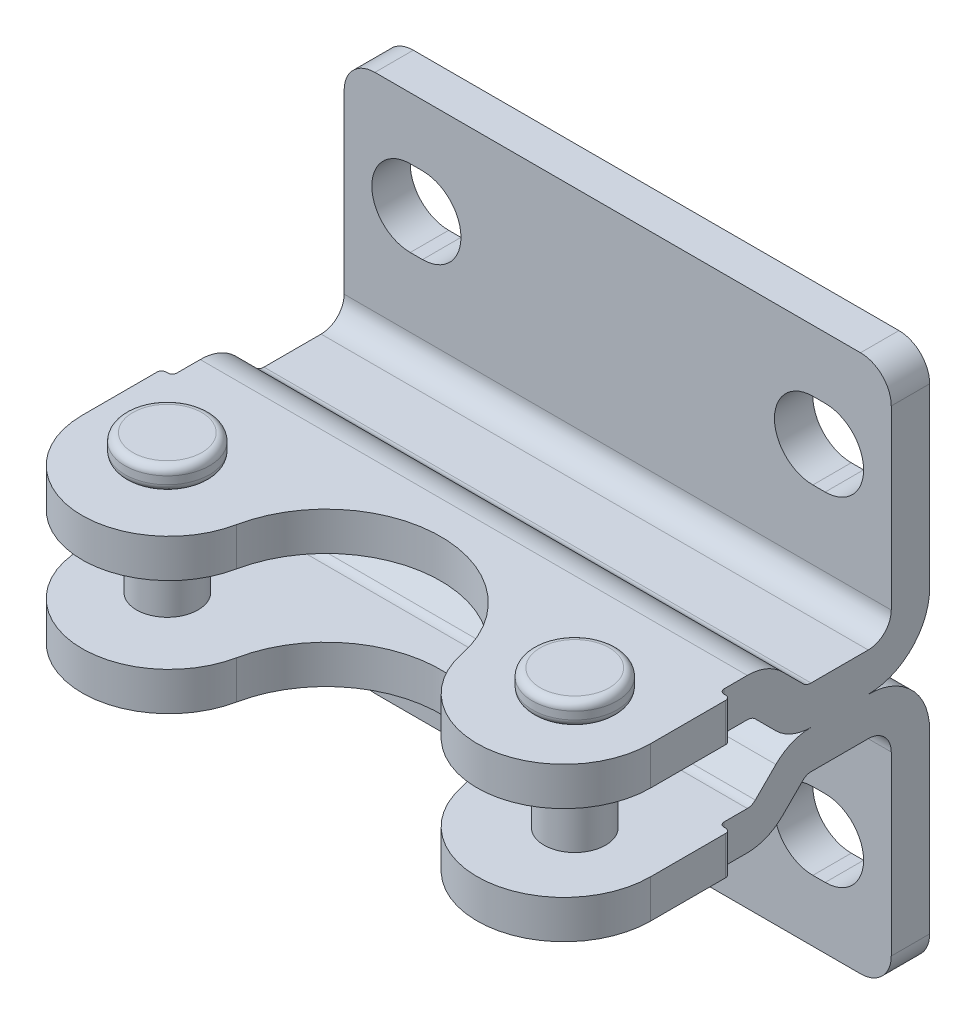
ISO-10303-21;
HEADER;
FILE_DESCRIPTION(('STEP AP214'),'2;1');
FILE_NAME('part.step','',(''),(''),'','','');
FILE_SCHEMA(('AUTOMOTIVE_DESIGN { 1 0 10303 214 1 1 1 1 }'));
ENDSEC;
DATA;
#1=APPLICATION_CONTEXT('core data for automotive mechanical design processes');
#2=APPLICATION_PROTOCOL_DEFINITION('international standard','automotive_design',2000,#1);
#3=PRODUCT_CONTEXT('',#1,'mechanical');
#4=PRODUCT('Part','Part','',(#3));
#5=PRODUCT_RELATED_PRODUCT_CATEGORY('part','',(#4));
#6=PRODUCT_DEFINITION_FORMATION('','',#4);
#7=PRODUCT_DEFINITION_CONTEXT('part definition',#1,'design');
#8=PRODUCT_DEFINITION('design','',#6,#7);
#9=PRODUCT_DEFINITION_SHAPE('','',#8);
#10=(LENGTH_UNIT() NAMED_UNIT(*) SI_UNIT(.MILLI.,.METRE.));
#11=(NAMED_UNIT(*) PLANE_ANGLE_UNIT() SI_UNIT($,.RADIAN.));
#12=(NAMED_UNIT(*) SI_UNIT($,.STERADIAN.) SOLID_ANGLE_UNIT());
#13=UNCERTAINTY_MEASURE_WITH_UNIT(LENGTH_MEASURE(1.E-05),#10,'distance_accuracy_value','');
#14=(GEOMETRIC_REPRESENTATION_CONTEXT(3) GLOBAL_UNCERTAINTY_ASSIGNED_CONTEXT((#13)) GLOBAL_UNIT_ASSIGNED_CONTEXT((#10,
#11,#12)) REPRESENTATION_CONTEXT('',''));
#15=CARTESIAN_POINT('',(0.,0.,0.));
#16=DIRECTION('',(0.,0.,1.));
#17=DIRECTION('',(1.,0.,0.));
#18=AXIS2_PLACEMENT_3D('',#15,#16,#17);
#19=CARTESIAN_POINT('',(0.243,4.50000000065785,18.55));
#20=DIRECTION('',(0.,-1.,0.));
#21=DIRECTION('',(0.907338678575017,0.,0.420400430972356));
#22=AXIS2_PLACEMENT_3D('',#19,#20,#21);
#23=PLANE('',#22);
#24=CARTESIAN_POINT('',(0.243,4.50000000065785,18.55));
#25=DIRECTION('',(0.,-1.,0.));
#26=DIRECTION('',(0.420400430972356,0.,-0.907338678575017));
#27=AXIS2_PLACEMENT_3D('',#24,#25,#26);
#28=CIRCLE('',#27,2.25);
#29=CARTESIAN_POINT('',(1.1889009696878,4.50000000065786,16.5084879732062));
#30=VERTEX_POINT('',#29);
#31=EDGE_CURVE('E2677',#30,#30,#28,.T.);
#32=ORIENTED_EDGE('',*,*,#31,.T.);
#33=EDGE_LOOP('',(#32));
#34=FACE_BOUND('',#33,.T.);
#35=ADVANCED_FACE('F14',(#34),#23,.T.);
#36=CARTESIAN_POINT('',(0.243,5.00000000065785,18.55));
#37=DIRECTION('',(0.,-1.,0.));
#38=DIRECTION('',(0.420400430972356,0.,-0.907338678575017));
#39=AXIS2_PLACEMENT_3D('',#36,#37,#38);
#40=TOROIDAL_SURFACE('',#39,2.25,0.5);
#41=ORIENTED_EDGE('',*,*,#31,.F.);
#42=EDGE_LOOP('',(#41));
#43=FACE_BOUND('',#42,.T.);
#44=CARTESIAN_POINT('',(0.243,5.00000000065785,18.55));
#45=DIRECTION('',(0.,1.,0.));
#46=DIRECTION('',(0.420400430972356,0.,-0.907338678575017));
#47=AXIS2_PLACEMENT_3D('',#44,#45,#46);
#48=CIRCLE('',#47,2.75);
#49=CARTESIAN_POINT('',(1.39910118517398,5.00000000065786,16.0548186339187));
#50=VERTEX_POINT('',#49);
#51=EDGE_CURVE('E3494',#50,#50,#48,.T.);
#52=ORIENTED_EDGE('',*,*,#51,.F.);
#53=EDGE_LOOP('',(#52));
#54=FACE_BOUND('',#53,.T.);
#55=ADVANCED_FACE('F3526',(#43,#54),#40,.T.);
#56=CARTESIAN_POINT('',(0.243,6.00000000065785,18.55));
#57=DIRECTION('',(0.,-1.,0.));
#58=DIRECTION('',(0.420400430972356,0.,-0.907338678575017));
#59=AXIS2_PLACEMENT_3D('',#56,#57,#58);
#60=CYLINDRICAL_SURFACE('',#59,2.75);
#61=ORIENTED_EDGE('',*,*,#51,.T.);
#62=EDGE_LOOP('',(#61));
#63=FACE_BOUND('',#62,.T.);
#64=CARTESIAN_POINT('',(0.243,5.50000000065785,18.55));
#65=DIRECTION('',(0.,-1.,0.));
#66=DIRECTION('',(-0.420400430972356,0.,0.907338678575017));
#67=AXIS2_PLACEMENT_3D('',#64,#65,#66);
#68=CIRCLE('',#67,2.75);
#69=CARTESIAN_POINT('',(-0.91310118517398,5.50000000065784,21.0451813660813));
#70=VERTEX_POINT('',#69);
#71=EDGE_CURVE('E3490',#70,#70,#68,.T.);
#72=ORIENTED_EDGE('',*,*,#71,.T.);
#73=EDGE_LOOP('',(#72));
#74=FACE_BOUND('',#73,.T.);
#75=ADVANCED_FACE('F3523',(#63,#74),#60,.T.);
#76=CARTESIAN_POINT('',(0.243,5.50000000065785,18.55));
#77=DIRECTION('',(0.,1.,0.));
#78=DIRECTION('',(-0.420400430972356,0.,0.907338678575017));
#79=AXIS2_PLACEMENT_3D('',#76,#77,#78);
#80=TOROIDAL_SURFACE('',#79,2.25,0.5);
#81=CARTESIAN_POINT('',(0.243,6.00000000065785,18.55));
#82=DIRECTION('',(0.,1.,0.));
#83=DIRECTION('',(-0.420400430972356,0.,0.907338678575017));
#84=AXIS2_PLACEMENT_3D('',#81,#82,#83);
#85=CIRCLE('',#84,2.25);
#86=CARTESIAN_POINT('',(-0.702900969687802,6.00000000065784,20.5915120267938));
#87=VERTEX_POINT('',#86);
#88=EDGE_CURVE('E3495',#87,#87,#85,.T.);
#89=ORIENTED_EDGE('',*,*,#88,.F.);
#90=EDGE_LOOP('',(#89));
#91=FACE_BOUND('',#90,.T.);
#92=ORIENTED_EDGE('',*,*,#71,.F.);
#93=EDGE_LOOP('',(#92));
#94=FACE_BOUND('',#93,.T.);
#95=ADVANCED_FACE('F3536',(#91,#94),#80,.T.);
#96=CARTESIAN_POINT('',(0.243,17.5000000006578,18.55));
#97=DIRECTION('',(0.,-1.,0.));
#98=DIRECTION('',(0.907338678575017,0.,0.420400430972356));
#99=AXIS2_PLACEMENT_3D('',#96,#97,#98);
#100=PLANE('',#99);
#101=CARTESIAN_POINT('',(0.243,17.5000000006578,18.55));
#102=DIRECTION('',(0.,1.,0.));
#103=DIRECTION('',(0.420400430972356,0.,-0.907338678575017));
#104=AXIS2_PLACEMENT_3D('',#101,#102,#103);
#105=CIRCLE('',#104,2.25);
#106=CARTESIAN_POINT('',(1.1889009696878,17.5000000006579,16.5084879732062));
#107=VERTEX_POINT('',#106);
#108=EDGE_CURVE('E3499',#107,#107,#105,.T.);
#109=ORIENTED_EDGE('',*,*,#108,.T.);
#110=EDGE_LOOP('',(#109));
#111=FACE_BOUND('',#110,.T.);
#112=ADVANCED_FACE('F3878',(#111),#100,.F.);
#113=CARTESIAN_POINT('',(0.243,17.0000000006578,18.55));
#114=DIRECTION('',(0.,-1.,0.));
#115=DIRECTION('',(0.420400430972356,0.,-0.907338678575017));
#116=AXIS2_PLACEMENT_3D('',#113,#114,#115);
#117=TOROIDAL_SURFACE('',#116,2.25,0.5);
#118=CARTESIAN_POINT('',(0.243,17.0000000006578,18.55));
#119=DIRECTION('',(0.,-1.,0.));
#120=DIRECTION('',(0.420400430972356,0.,-0.907338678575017));
#121=AXIS2_PLACEMENT_3D('',#118,#119,#120);
#122=CIRCLE('',#121,2.75);
#123=CARTESIAN_POINT('',(1.39910118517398,17.0000000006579,16.0548186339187));
#124=VERTEX_POINT('',#123);
#125=EDGE_CURVE('E3500',#124,#124,#122,.T.);
#126=ORIENTED_EDGE('',*,*,#125,.F.);
#127=EDGE_LOOP('',(#126));
#128=FACE_BOUND('',#127,.T.);
#129=ORIENTED_EDGE('',*,*,#108,.F.);
#130=EDGE_LOOP('',(#129));
#131=FACE_BOUND('',#130,.T.);
#132=ADVANCED_FACE('F3551',(#128,#131),#117,.T.);
#133=CARTESIAN_POINT('',(0.243,16.0000000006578,18.55));
#134=DIRECTION('',(0.,1.,0.));
#135=DIRECTION('',(-0.420400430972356,0.,0.907338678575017));
#136=AXIS2_PLACEMENT_3D('',#133,#134,#135);
#137=CYLINDRICAL_SURFACE('',#136,2.75);
#138=ORIENTED_EDGE('',*,*,#125,.T.);
#139=EDGE_LOOP('',(#138));
#140=FACE_BOUND('',#139,.T.);
#141=CARTESIAN_POINT('',(0.243,16.5000000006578,18.55));
#142=DIRECTION('',(0.,1.,0.));
#143=DIRECTION('',(0.420400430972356,0.,-0.907338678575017));
#144=AXIS2_PLACEMENT_3D('',#141,#142,#143);
#145=CIRCLE('',#144,2.75);
#146=CARTESIAN_POINT('',(1.39910118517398,16.5000000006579,16.0548186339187));
#147=VERTEX_POINT('',#146);
#148=EDGE_CURVE('E3504',#147,#147,#145,.T.);
#149=ORIENTED_EDGE('',*,*,#148,.T.);
#150=EDGE_LOOP('',(#149));
#151=FACE_BOUND('',#150,.T.);
#152=ADVANCED_FACE('F3548',(#140,#151),#137,.T.);
#153=CARTESIAN_POINT('',(0.243,16.5000000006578,18.55));
#154=DIRECTION('',(0.,-1.,0.));
#155=DIRECTION('',(0.420400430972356,0.,-0.907338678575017));
#156=AXIS2_PLACEMENT_3D('',#153,#154,#155);
#157=TOROIDAL_SURFACE('',#156,2.25,0.5);
#158=CARTESIAN_POINT('',(0.243,16.0000000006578,18.55));
#159=DIRECTION('',(0.,-1.,0.));
#160=DIRECTION('',(0.420400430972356,0.,-0.907338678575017));
#161=AXIS2_PLACEMENT_3D('',#158,#159,#160);
#162=CIRCLE('',#161,2.25);
#163=CARTESIAN_POINT('',(1.1889009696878,16.0000000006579,16.5084879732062));
#164=VERTEX_POINT('',#163);
#165=EDGE_CURVE('E3505',#164,#164,#162,.T.);
#166=ORIENTED_EDGE('',*,*,#165,.F.);
#167=EDGE_LOOP('',(#166));
#168=FACE_BOUND('',#167,.T.);
#169=ORIENTED_EDGE('',*,*,#148,.F.);
#170=EDGE_LOOP('',(#169));
#171=FACE_BOUND('',#170,.T.);
#172=ADVANCED_FACE('F3546',(#168,#171),#157,.T.);
#173=CARTESIAN_POINT('',(0.243,4.50000000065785,18.55));
#174=DIRECTION('',(0.,1.,0.));
#175=DIRECTION('',(-0.420400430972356,0.,0.907338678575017));
#176=AXIS2_PLACEMENT_3D('',#173,#174,#175);
#177=CYLINDRICAL_SURFACE('',#176,2.);
#178=CARTESIAN_POINT('',(0.243,13.5000000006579,18.55));
#179=DIRECTION('',(0.,1.,0.));
#180=DIRECTION('',(0.,0.,1.));
#181=AXIS2_PLACEMENT_3D('',#178,#179,#180);
#182=CIRCLE('',#181,2.);
#183=CARTESIAN_POINT('',(0.243,13.5000000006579,20.55));
#184=VERTEX_POINT('',#183);
#185=EDGE_CURVE('E25',#184,#184,#182,.F.);
#186=ORIENTED_EDGE('',*,*,#185,.T.);
#187=EDGE_LOOP('',(#186));
#188=FACE_BOUND('',#187,.T.);
#189=CARTESIAN_POINT('',(0.243,8.50000000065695,18.55));
#190=DIRECTION('',(0.,-1.,0.));
#191=DIRECTION('',(0.,0.,-1.));
#192=AXIS2_PLACEMENT_3D('',#189,#190,#191);
#193=CIRCLE('',#192,2.);
#194=CARTESIAN_POINT('',(0.243,8.50000000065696,16.55));
#195=VERTEX_POINT('',#194);
#196=EDGE_CURVE('E9',#195,#195,#193,.F.);
#197=ORIENTED_EDGE('',*,*,#196,.T.);
#198=EDGE_LOOP('',(#197));
#199=FACE_BOUND('',#198,.T.);
#200=ADVANCED_FACE('F1791',(#188,#199),#177,.T.);
#201=CARTESIAN_POINT('',(13.5,-6.799999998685,0.));
#202=DIRECTION('',(0.,0.,1.));
#203=DIRECTION('',(-1.,0.,0.));
#204=AXIS2_PLACEMENT_3D('',#201,#202,#203);
#205=PLANE('',#204);
#206=DIRECTION('',(1.,0.,0.));
#207=VECTOR('',#206,1.);
#208=CARTESIAN_POINT('',(13.5,15.000000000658,1.2490009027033E-13));
#209=LINE('',#208,#207);
#210=CARTESIAN_POINT('',(-4.3,15.000000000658,1.2490009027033E-13));
#211=VERTEX_POINT('',#210);
#212=CARTESIAN_POINT('',(31.3,15.000000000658,1.2490009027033E-13));
#213=VERTEX_POINT('',#212);
#214=EDGE_CURVE('E662',#211,#213,#209,.T.);
#215=ORIENTED_EDGE('',*,*,#214,.F.);
#216=DIRECTION('',(0.,1.,0.));
#217=VECTOR('',#216,1.);
#218=CARTESIAN_POINT('',(-4.3,1.000000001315,0.));
#219=LINE('',#218,#217);
#220=CARTESIAN_POINT('',(-4.3,26.500000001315,2.22044604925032E-13));
#221=VERTEX_POINT('',#220);
#222=EDGE_CURVE('E831',#211,#221,#219,.T.);
#223=ORIENTED_EDGE('',*,*,#222,.T.);
#224=CARTESIAN_POINT('',(-2.3,26.500000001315,2.22044604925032E-13));
#225=DIRECTION('',(0.,0.,-1.));
#226=DIRECTION('',(-1.,0.,0.));
#227=AXIS2_PLACEMENT_3D('',#224,#225,#226);
#228=CIRCLE('',#227,2.);
#229=CARTESIAN_POINT('',(-2.3,28.500000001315,2.4980018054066E-13));
#230=VERTEX_POINT('',#229);
#231=EDGE_CURVE('E828',#221,#230,#228,.T.);
#232=ORIENTED_EDGE('',*,*,#231,.T.);
#233=DIRECTION('',(-1.,0.,0.));
#234=VECTOR('',#233,1.);
#235=CARTESIAN_POINT('',(32.,28.500000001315,2.4980018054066E-13));
#236=LINE('',#235,#234);
#237=CARTESIAN_POINT('',(29.3,28.500000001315,2.4980018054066E-13));
#238=VERTEX_POINT('',#237);
#239=EDGE_CURVE('E576',#238,#230,#236,.T.);
#240=ORIENTED_EDGE('',*,*,#239,.F.);
#241=CARTESIAN_POINT('',(29.3,26.500000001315,2.22044604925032E-13));
#242=DIRECTION('',(0.,0.,-1.));
#243=DIRECTION('',(-1.,0.,0.));
#244=AXIS2_PLACEMENT_3D('',#241,#242,#243);
#245=CIRCLE('',#244,2.);
#246=CARTESIAN_POINT('',(31.3,26.500000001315,2.22044604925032E-13));
#247=VERTEX_POINT('',#246);
#248=EDGE_CURVE('E832',#238,#247,#245,.T.);
#249=ORIENTED_EDGE('',*,*,#248,.T.);
#250=DIRECTION('',(0.,-1.,0.));
#251=VECTOR('',#250,1.);
#252=CARTESIAN_POINT('',(31.3,-6.799999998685,0.));
#253=LINE('',#252,#251);
#254=EDGE_CURVE('E18',#247,#213,#253,.T.);
#255=ORIENTED_EDGE('',*,*,#254,.T.);
#256=EDGE_LOOP('',(#215,#223,#232,#240,#249,#255));
#257=FACE_BOUND('',#256,.T.);
#258=DIRECTION('',(1.,0.,0.));
#259=VECTOR('',#258,1.);
#260=CARTESIAN_POINT('',(13.5,19.500000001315,1.66533453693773E-13));
#261=LINE('',#260,#259);
#262=CARTESIAN_POINT('',(26.2,19.500000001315,1.66533453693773E-13));
#263=VERTEX_POINT('',#262);
#264=CARTESIAN_POINT('',(27.,19.500000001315,1.66533453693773E-13));
#265=VERTEX_POINT('',#264);
#266=EDGE_CURVE('E713',#263,#265,#261,.T.);
#267=ORIENTED_EDGE('',*,*,#266,.T.);
#268=CARTESIAN_POINT('',(27.,22.000000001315,1.94289029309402E-13));
#269=DIRECTION('',(0.,0.,1.));
#270=DIRECTION('',(-1.,0.,0.));
#271=AXIS2_PLACEMENT_3D('',#268,#269,#270);
#272=CIRCLE('',#271,2.5);
#273=CARTESIAN_POINT('',(27.,24.500000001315,2.08166817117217E-13));
#274=VERTEX_POINT('',#273);
#275=EDGE_CURVE('E710',#265,#274,#272,.T.);
#276=ORIENTED_EDGE('',*,*,#275,.T.);
#277=DIRECTION('',(-1.,0.,0.));
#278=VECTOR('',#277,1.);
#279=CARTESIAN_POINT('',(13.5,24.500000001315,2.08166817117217E-13));
#280=LINE('',#279,#278);
#281=CARTESIAN_POINT('',(26.2,24.500000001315,2.08166817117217E-13));
#282=VERTEX_POINT('',#281);
#283=EDGE_CURVE('E714',#274,#282,#280,.T.);
#284=ORIENTED_EDGE('',*,*,#283,.T.);
#285=CARTESIAN_POINT('',(26.2,22.000000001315,1.94289029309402E-13));
#286=DIRECTION('',(0.,0.,1.));
#287=DIRECTION('',(-1.,0.,0.));
#288=AXIS2_PLACEMENT_3D('',#285,#286,#287);
#289=CIRCLE('',#288,2.5);
#290=EDGE_CURVE('E767',#282,#263,#289,.T.);
#291=ORIENTED_EDGE('',*,*,#290,.T.);
#292=EDGE_LOOP('',(#267,#276,#284,#291));
#293=FACE_BOUND('',#292,.T.);
#294=DIRECTION('',(-1.,0.,0.));
#295=VECTOR('',#294,1.);
#296=CARTESIAN_POINT('',(13.5,24.500000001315,2.08166817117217E-13));
#297=LINE('',#296,#295);
#298=CARTESIAN_POINT('',(0.8,24.500000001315,2.08166817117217E-13));
#299=VERTEX_POINT('',#298);
#300=CARTESIAN_POINT('',(0.,24.500000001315,2.08166817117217E-13));
#301=VERTEX_POINT('',#300);
#302=EDGE_CURVE('E770',#299,#301,#297,.T.);
#303=ORIENTED_EDGE('',*,*,#302,.T.);
#304=CARTESIAN_POINT('',(0.,22.000000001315,1.94289029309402E-13));
#305=DIRECTION('',(0.,0.,1.));
#306=DIRECTION('',(-1.,0.,0.));
#307=AXIS2_PLACEMENT_3D('',#304,#305,#306);
#308=CIRCLE('',#307,2.5);
#309=CARTESIAN_POINT('',(0.,19.500000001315,1.66533453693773E-13));
#310=VERTEX_POINT('',#309);
#311=EDGE_CURVE('E547',#301,#310,#308,.T.);
#312=ORIENTED_EDGE('',*,*,#311,.T.);
#313=DIRECTION('',(1.,0.,0.));
#314=VECTOR('',#313,1.);
#315=CARTESIAN_POINT('',(13.5,19.500000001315,1.66533453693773E-13));
#316=LINE('',#315,#314);
#317=CARTESIAN_POINT('',(0.8,19.500000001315,1.66533453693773E-13));
#318=VERTEX_POINT('',#317);
#319=EDGE_CURVE('E542',#310,#318,#316,.T.);
#320=ORIENTED_EDGE('',*,*,#319,.T.);
#321=CARTESIAN_POINT('',(0.8,22.000000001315,1.94289029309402E-13));
#322=DIRECTION('',(0.,0.,1.));
#323=DIRECTION('',(-1.,0.,0.));
#324=AXIS2_PLACEMENT_3D('',#321,#322,#323);
#325=CIRCLE('',#324,2.5);
#326=EDGE_CURVE('E531',#318,#299,#325,.T.);
#327=ORIENTED_EDGE('',*,*,#326,.T.);
#328=EDGE_LOOP('',(#303,#312,#320,#327));
#329=FACE_BOUND('',#328,.T.);
#330=ADVANCED_FACE('F546',(#257,#293,#329),#205,.F.);
#331=CARTESIAN_POINT('',(13.5,28.8,0.));
#332=DIRECTION('',(0.,0.,1.));
#333=DIRECTION('',(1.,0.,0.));
#334=AXIS2_PLACEMENT_3D('',#331,#332,#333);
#335=PLANE('',#334);
#336=DIRECTION('',(-1.,0.,0.));
#337=VECTOR('',#336,1.);
#338=CARTESIAN_POINT('',(13.5,7.000000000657,0.));
#339=LINE('',#338,#337);
#340=CARTESIAN_POINT('',(31.3,7.000000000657,0.));
#341=VERTEX_POINT('',#340);
#342=CARTESIAN_POINT('',(-4.3,7.000000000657,0.));
#343=VERTEX_POINT('',#342);
#344=EDGE_CURVE('E2981',#341,#343,#339,.T.);
#345=ORIENTED_EDGE('',*,*,#344,.F.);
#346=DIRECTION('',(0.,-1.,0.));
#347=VECTOR('',#346,1.);
#348=CARTESIAN_POINT('',(31.3,21.,0.));
#349=LINE('',#348,#347);
#350=CARTESIAN_POINT('',(31.3,-4.5,0.));
#351=VERTEX_POINT('',#350);
#352=EDGE_CURVE('E2852',#341,#351,#349,.T.);
#353=ORIENTED_EDGE('',*,*,#352,.T.);
#354=CARTESIAN_POINT('',(29.3,-4.5,0.));
#355=DIRECTION('',(0.,0.,-1.));
#356=DIRECTION('',(1.,0.,0.));
#357=AXIS2_PLACEMENT_3D('',#354,#355,#356);
#358=CIRCLE('',#357,2.);
#359=CARTESIAN_POINT('',(29.3,-6.5,0.));
#360=VERTEX_POINT('',#359);
#361=EDGE_CURVE('E2859',#351,#360,#358,.T.);
#362=ORIENTED_EDGE('',*,*,#361,.T.);
#363=DIRECTION('',(1.,0.,0.));
#364=VECTOR('',#363,1.);
#365=CARTESIAN_POINT('',(-5.,-6.5,0.));
#366=LINE('',#365,#364);
#367=CARTESIAN_POINT('',(-2.3,-6.5,0.));
#368=VERTEX_POINT('',#367);
#369=EDGE_CURVE('E2824',#368,#360,#366,.T.);
#370=ORIENTED_EDGE('',*,*,#369,.F.);
#371=CARTESIAN_POINT('',(-2.3,-4.5,0.));
#372=DIRECTION('',(0.,0.,-1.));
#373=DIRECTION('',(1.,0.,0.));
#374=AXIS2_PLACEMENT_3D('',#371,#372,#373);
#375=CIRCLE('',#374,2.);
#376=CARTESIAN_POINT('',(-4.3,-4.5,0.));
#377=VERTEX_POINT('',#376);
#378=EDGE_CURVE('E2865',#368,#377,#375,.T.);
#379=ORIENTED_EDGE('',*,*,#378,.T.);
#380=DIRECTION('',(0.,1.,0.));
#381=VECTOR('',#380,1.);
#382=CARTESIAN_POINT('',(-4.3,28.8,0.));
#383=LINE('',#382,#381);
#384=EDGE_CURVE('E2872',#377,#343,#383,.T.);
#385=ORIENTED_EDGE('',*,*,#384,.T.);
#386=EDGE_LOOP('',(#345,#353,#362,#370,#379,#385));
#387=FACE_BOUND('',#386,.T.);
#388=DIRECTION('',(-1.,0.,0.));
#389=VECTOR('',#388,1.);
#390=CARTESIAN_POINT('',(13.5,2.5,0.));
#391=LINE('',#390,#389);
#392=CARTESIAN_POINT('',(0.8,2.5,0.));
#393=VERTEX_POINT('',#392);
#394=CARTESIAN_POINT('',(0.,2.5,0.));
#395=VERTEX_POINT('',#394);
#396=EDGE_CURVE('E2879',#393,#395,#391,.T.);
#397=ORIENTED_EDGE('',*,*,#396,.T.);
#398=CARTESIAN_POINT('',(0.,0.,0.));
#399=DIRECTION('',(0.,0.,1.));
#400=DIRECTION('',(1.,0.,0.));
#401=AXIS2_PLACEMENT_3D('',#398,#399,#400);
#402=CIRCLE('',#401,2.5);
#403=CARTESIAN_POINT('',(0.,-2.5,0.));
#404=VERTEX_POINT('',#403);
#405=EDGE_CURVE('E2886',#395,#404,#402,.T.);
#406=ORIENTED_EDGE('',*,*,#405,.T.);
#407=DIRECTION('',(1.,0.,0.));
#408=VECTOR('',#407,1.);
#409=CARTESIAN_POINT('',(13.5,-2.5,0.));
#410=LINE('',#409,#408);
#411=CARTESIAN_POINT('',(0.8,-2.5,0.));
#412=VERTEX_POINT('',#411);
#413=EDGE_CURVE('E2893',#404,#412,#410,.T.);
#414=ORIENTED_EDGE('',*,*,#413,.T.);
#415=CARTESIAN_POINT('',(0.8,0.,0.));
#416=DIRECTION('',(0.,0.,1.));
#417=DIRECTION('',(1.,0.,0.));
#418=AXIS2_PLACEMENT_3D('',#415,#416,#417);
#419=CIRCLE('',#418,2.5);
#420=EDGE_CURVE('E2900',#412,#393,#419,.T.);
#421=ORIENTED_EDGE('',*,*,#420,.T.);
#422=EDGE_LOOP('',(#397,#406,#414,#421));
#423=FACE_BOUND('',#422,.T.);
#424=DIRECTION('',(1.,0.,0.));
#425=VECTOR('',#424,1.);
#426=CARTESIAN_POINT('',(13.5,-2.5,0.));
#427=LINE('',#426,#425);
#428=CARTESIAN_POINT('',(26.2,-2.5,0.));
#429=VERTEX_POINT('',#428);
#430=CARTESIAN_POINT('',(27.,-2.5,0.));
#431=VERTEX_POINT('',#430);
#432=EDGE_CURVE('E2906',#429,#431,#427,.T.);
#433=ORIENTED_EDGE('',*,*,#432,.T.);
#434=CARTESIAN_POINT('',(27.,0.,0.));
#435=DIRECTION('',(0.,0.,1.));
#436=DIRECTION('',(1.,0.,0.));
#437=AXIS2_PLACEMENT_3D('',#434,#435,#436);
#438=CIRCLE('',#437,2.5);
#439=CARTESIAN_POINT('',(27.,2.5,0.));
#440=VERTEX_POINT('',#439);
#441=EDGE_CURVE('E2914',#431,#440,#438,.T.);
#442=ORIENTED_EDGE('',*,*,#441,.T.);
#443=DIRECTION('',(-1.,0.,0.));
#444=VECTOR('',#443,1.);
#445=CARTESIAN_POINT('',(13.5,2.5,0.));
#446=LINE('',#445,#444);
#447=CARTESIAN_POINT('',(26.2,2.5,0.));
#448=VERTEX_POINT('',#447);
#449=EDGE_CURVE('E2920',#440,#448,#446,.T.);
#450=ORIENTED_EDGE('',*,*,#449,.T.);
#451=CARTESIAN_POINT('',(26.2,0.,0.));
#452=DIRECTION('',(0.,0.,1.));
#453=DIRECTION('',(1.,0.,0.));
#454=AXIS2_PLACEMENT_3D('',#451,#452,#453);
#455=CIRCLE('',#454,2.5);
#456=EDGE_CURVE('E2928',#448,#429,#455,.T.);
#457=ORIENTED_EDGE('',*,*,#456,.T.);
#458=EDGE_LOOP('',(#433,#442,#450,#457));
#459=FACE_BOUND('',#458,.T.);
#460=ADVANCED_FACE('F1938',(#387,#423,#459),#335,.F.);
#461=CARTESIAN_POINT('',(0.,22.000000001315,-7.49999999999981));
#462=DIRECTION('',(0.,0.,1.));
#463=DIRECTION('',(-1.,0.,0.));
#464=AXIS2_PLACEMENT_3D('',#461,#462,#463);
#465=CYLINDRICAL_SURFACE('',#464,2.5);
#466=DIRECTION('',(0.,0.,1.));
#467=VECTOR('',#466,1.);
#468=CARTESIAN_POINT('',(0.,19.500000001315,-7.49999999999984));
#469=LINE('',#468,#467);
#470=CARTESIAN_POINT('',(0.,19.500000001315,2.50000000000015));
#471=VERTEX_POINT('',#470);
#472=EDGE_CURVE('E566',#310,#471,#469,.T.);
#473=ORIENTED_EDGE('',*,*,#472,.F.);
#474=ORIENTED_EDGE('',*,*,#311,.F.);
#475=DIRECTION('',(0.,0.,1.));
#476=VECTOR('',#475,1.);
#477=CARTESIAN_POINT('',(0.,24.5000000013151,-7.4999999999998));
#478=LINE('',#477,#476);
#479=CARTESIAN_POINT('',(0.,24.500000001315,2.5000000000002));
#480=VERTEX_POINT('',#479);
#481=EDGE_CURVE('E759',#301,#480,#478,.T.);
#482=ORIENTED_EDGE('',*,*,#481,.T.);
#483=CARTESIAN_POINT('',(0.,22.000000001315,2.50000000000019));
#484=DIRECTION('',(0.,0.,1.));
#485=DIRECTION('',(-1.,0.,0.));
#486=AXIS2_PLACEMENT_3D('',#483,#484,#485);
#487=CIRCLE('',#486,2.5);
#488=EDGE_CURVE('E849',#480,#471,#487,.T.);
#489=ORIENTED_EDGE('',*,*,#488,.T.);
#490=EDGE_LOOP('',(#473,#474,#482,#489));
#491=FACE_BOUND('',#490,.T.);
#492=ADVANCED_FACE('F1950',(#491),#465,.F.);
#493=CARTESIAN_POINT('',(0.,19.500000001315,-7.49999999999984));
#494=DIRECTION('',(0.,-1.,0.));
#495=DIRECTION('',(-1.,0.,0.));
#496=AXIS2_PLACEMENT_3D('',#493,#494,#495);
#497=PLANE('',#496);
#498=ORIENTED_EDGE('',*,*,#472,.T.);
#499=DIRECTION('',(1.,0.,0.));
#500=VECTOR('',#499,1.);
#501=CARTESIAN_POINT('',(0.,19.500000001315,2.50000000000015));
#502=LINE('',#501,#500);
#503=CARTESIAN_POINT('',(0.8,19.500000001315,2.50000000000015));
#504=VERTEX_POINT('',#503);
#505=EDGE_CURVE('E554',#471,#504,#502,.T.);
#506=ORIENTED_EDGE('',*,*,#505,.T.);
#507=DIRECTION('',(0.,0.,1.));
#508=VECTOR('',#507,1.);
#509=CARTESIAN_POINT('',(0.8,19.500000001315,-7.49999999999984));
#510=LINE('',#509,#508);
#511=EDGE_CURVE('E535',#318,#504,#510,.T.);
#512=ORIENTED_EDGE('',*,*,#511,.F.);
#513=ORIENTED_EDGE('',*,*,#319,.F.);
#514=EDGE_LOOP('',(#498,#506,#512,#513));
#515=FACE_BOUND('',#514,.T.);
#516=ADVANCED_FACE('F552',(#515),#497,.F.);
#517=CARTESIAN_POINT('',(0.8,22.000000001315,-7.49999999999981));
#518=DIRECTION('',(0.,0.,1.));
#519=DIRECTION('',(-1.,0.,0.));
#520=AXIS2_PLACEMENT_3D('',#517,#518,#519);
#521=CYLINDRICAL_SURFACE('',#520,2.5);
#522=ORIENTED_EDGE('',*,*,#511,.T.);
#523=CARTESIAN_POINT('',(0.8,22.000000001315,2.50000000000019));
#524=DIRECTION('',(0.,0.,1.));
#525=DIRECTION('',(-1.,0.,0.));
#526=AXIS2_PLACEMENT_3D('',#523,#524,#525);
#527=CIRCLE('',#526,2.5);
#528=CARTESIAN_POINT('',(0.8,24.500000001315,2.5000000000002));
#529=VERTEX_POINT('',#528);
#530=EDGE_CURVE('E558',#504,#529,#527,.T.);
#531=ORIENTED_EDGE('',*,*,#530,.T.);
#532=DIRECTION('',(0.,0.,1.));
#533=VECTOR('',#532,1.);
#534=CARTESIAN_POINT('',(0.8,24.5000000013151,-7.4999999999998));
#535=LINE('',#534,#533);
#536=EDGE_CURVE('E537',#299,#529,#535,.T.);
#537=ORIENTED_EDGE('',*,*,#536,.F.);
#538=ORIENTED_EDGE('',*,*,#326,.F.);
#539=EDGE_LOOP('',(#522,#531,#537,#538));
#540=FACE_BOUND('',#539,.T.);
#541=ADVANCED_FACE('F533',(#540),#521,.F.);
#542=CARTESIAN_POINT('',(0.,24.5000000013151,-7.4999999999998));
#543=DIRECTION('',(0.,1.,0.));
#544=DIRECTION('',(0.,0.,-1.));
#545=AXIS2_PLACEMENT_3D('',#542,#543,#544);
#546=PLANE('',#545);
#547=ORIENTED_EDGE('',*,*,#536,.T.);
#548=DIRECTION('',(-1.,0.,0.));
#549=VECTOR('',#548,1.);
#550=CARTESIAN_POINT('',(0.,24.500000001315,2.5000000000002));
#551=LINE('',#550,#549);
#552=EDGE_CURVE('E557',#529,#480,#551,.T.);
#553=ORIENTED_EDGE('',*,*,#552,.T.);
#554=ORIENTED_EDGE('',*,*,#481,.F.);
#555=ORIENTED_EDGE('',*,*,#302,.F.);
#556=EDGE_LOOP('',(#547,#553,#554,#555));
#557=FACE_BOUND('',#556,.T.);
#558=ADVANCED_FACE('F1983',(#557),#546,.F.);
#559=CARTESIAN_POINT('',(27.,24.5000000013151,-7.4999999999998));
#560=DIRECTION('',(0.,1.,0.));
#561=DIRECTION('',(0.,0.,-1.));
#562=AXIS2_PLACEMENT_3D('',#559,#560,#561);
#563=PLANE('',#562);
#564=DIRECTION('',(0.,0.,1.));
#565=VECTOR('',#564,1.);
#566=CARTESIAN_POINT('',(27.,24.5000000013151,-7.4999999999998));
#567=LINE('',#566,#565);
#568=CARTESIAN_POINT('',(27.,24.500000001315,2.5000000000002));
#569=VERTEX_POINT('',#568);
#570=EDGE_CURVE('E642',#274,#569,#567,.T.);
#571=ORIENTED_EDGE('',*,*,#570,.T.);
#572=DIRECTION('',(-1.,0.,0.));
#573=VECTOR('',#572,1.);
#574=CARTESIAN_POINT('',(27.,24.500000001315,2.5000000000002));
#575=LINE('',#574,#573);
#576=CARTESIAN_POINT('',(26.2,24.500000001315,2.5000000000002));
#577=VERTEX_POINT('',#576);
#578=EDGE_CURVE('E752',#569,#577,#575,.T.);
#579=ORIENTED_EDGE('',*,*,#578,.T.);
#580=DIRECTION('',(0.,0.,1.));
#581=VECTOR('',#580,1.);
#582=CARTESIAN_POINT('',(26.2,24.5000000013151,-7.4999999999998));
#583=LINE('',#582,#581);
#584=EDGE_CURVE('E637',#282,#577,#583,.T.);
#585=ORIENTED_EDGE('',*,*,#584,.F.);
#586=ORIENTED_EDGE('',*,*,#283,.F.);
#587=EDGE_LOOP('',(#571,#579,#585,#586));
#588=FACE_BOUND('',#587,.T.);
#589=ADVANCED_FACE('F1993',(#588),#563,.F.);
#590=CARTESIAN_POINT('',(26.2,22.000000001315,-7.49999999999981));
#591=DIRECTION('',(0.,0.,1.));
#592=DIRECTION('',(-1.,0.,0.));
#593=AXIS2_PLACEMENT_3D('',#590,#591,#592);
#594=CYLINDRICAL_SURFACE('',#593,2.5);
#595=ORIENTED_EDGE('',*,*,#584,.T.);
#596=CARTESIAN_POINT('',(26.2,22.000000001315,2.50000000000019));
#597=DIRECTION('',(0.,0.,1.));
#598=DIRECTION('',(-1.,0.,0.));
#599=AXIS2_PLACEMENT_3D('',#596,#597,#598);
#600=CIRCLE('',#599,2.5);
#601=CARTESIAN_POINT('',(26.2,19.500000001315,2.50000000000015));
#602=VERTEX_POINT('',#601);
#603=EDGE_CURVE('E570',#577,#602,#600,.T.);
#604=ORIENTED_EDGE('',*,*,#603,.T.);
#605=DIRECTION('',(0.,0.,1.));
#606=VECTOR('',#605,1.);
#607=CARTESIAN_POINT('',(26.2,19.500000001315,-7.49999999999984));
#608=LINE('',#607,#606);
#609=EDGE_CURVE('E816',#263,#602,#608,.T.);
#610=ORIENTED_EDGE('',*,*,#609,.F.);
#611=ORIENTED_EDGE('',*,*,#290,.F.);
#612=EDGE_LOOP('',(#595,#604,#610,#611));
#613=FACE_BOUND('',#612,.T.);
#614=ADVANCED_FACE('F2004',(#613),#594,.F.);
#615=CARTESIAN_POINT('',(27.,19.500000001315,-7.49999999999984));
#616=DIRECTION('',(0.,-1.,0.));
#617=DIRECTION('',(-1.,0.,0.));
#618=AXIS2_PLACEMENT_3D('',#615,#616,#617);
#619=PLANE('',#618);
#620=ORIENTED_EDGE('',*,*,#609,.T.);
#621=DIRECTION('',(1.,0.,0.));
#622=VECTOR('',#621,1.);
#623=CARTESIAN_POINT('',(27.,19.500000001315,2.50000000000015));
#624=LINE('',#623,#622);
#625=CARTESIAN_POINT('',(27.,19.500000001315,2.50000000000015));
#626=VERTEX_POINT('',#625);
#627=EDGE_CURVE('E641',#602,#626,#624,.T.);
#628=ORIENTED_EDGE('',*,*,#627,.T.);
#629=DIRECTION('',(0.,0.,1.));
#630=VECTOR('',#629,1.);
#631=CARTESIAN_POINT('',(27.,19.500000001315,-7.49999999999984));
#632=LINE('',#631,#630);
#633=EDGE_CURVE('E705',#265,#626,#632,.T.);
#634=ORIENTED_EDGE('',*,*,#633,.F.);
#635=ORIENTED_EDGE('',*,*,#266,.F.);
#636=EDGE_LOOP('',(#620,#628,#634,#635));
#637=FACE_BOUND('',#636,.T.);
#638=ADVANCED_FACE('F2015',(#637),#619,.F.);
#639=CARTESIAN_POINT('',(27.,22.000000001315,-7.49999999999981));
#640=DIRECTION('',(0.,0.,1.));
#641=DIRECTION('',(-1.,0.,0.));
#642=AXIS2_PLACEMENT_3D('',#639,#640,#641);
#643=CYLINDRICAL_SURFACE('',#642,2.5);
#644=ORIENTED_EDGE('',*,*,#633,.T.);
#645=CARTESIAN_POINT('',(27.,22.000000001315,2.50000000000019));
#646=DIRECTION('',(0.,0.,1.));
#647=DIRECTION('',(-1.,0.,0.));
#648=AXIS2_PLACEMENT_3D('',#645,#646,#647);
#649=CIRCLE('',#648,2.5);
#650=EDGE_CURVE('E709',#626,#569,#649,.T.);
#651=ORIENTED_EDGE('',*,*,#650,.T.);
#652=ORIENTED_EDGE('',*,*,#570,.F.);
#653=ORIENTED_EDGE('',*,*,#275,.F.);
#654=EDGE_LOOP('',(#644,#651,#652,#653));
#655=FACE_BOUND('',#654,.T.);
#656=ADVANCED_FACE('F2026',(#655),#643,.F.);
#657=CARTESIAN_POINT('',(-2.3,26.500000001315,2.50000000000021));
#658=DIRECTION('',(0.,0.,1.));
#659=DIRECTION('',(-1.,0.,0.));
#660=AXIS2_PLACEMENT_3D('',#657,#658,#659);
#661=CYLINDRICAL_SURFACE('',#660,2.);
#662=ORIENTED_EDGE('',*,*,#231,.F.);
#663=DIRECTION('',(0.,0.,-1.));
#664=VECTOR('',#663,1.);
#665=CARTESIAN_POINT('',(-4.3,26.500000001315,2.22044604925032E-13));
#666=LINE('',#665,#664);
#667=CARTESIAN_POINT('',(-4.3,26.500000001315,2.50000000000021));
#668=VERTEX_POINT('',#667);
#669=EDGE_CURVE('E693',#668,#221,#666,.T.);
#670=ORIENTED_EDGE('',*,*,#669,.F.);
#671=CARTESIAN_POINT('',(-2.3,26.500000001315,2.50000000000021));
#672=DIRECTION('',(0.,0.,1.));
#673=DIRECTION('',(-1.,0.,0.));
#674=AXIS2_PLACEMENT_3D('',#671,#672,#673);
#675=CIRCLE('',#674,2.);
#676=CARTESIAN_POINT('',(-2.3,28.500000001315,2.50000000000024));
#677=VERTEX_POINT('',#676);
#678=EDGE_CURVE('E588',#677,#668,#675,.T.);
#679=ORIENTED_EDGE('',*,*,#678,.F.);
#680=DIRECTION('',(0.,0.,1.));
#681=VECTOR('',#680,1.);
#682=CARTESIAN_POINT('',(-2.3,28.500000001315,2.50000000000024));
#683=LINE('',#682,#681);
#684=EDGE_CURVE('E572',#230,#677,#683,.T.);
#685=ORIENTED_EDGE('',*,*,#684,.F.);
#686=EDGE_LOOP('',(#662,#670,#679,#685));
#687=FACE_BOUND('',#686,.T.);
#688=ADVANCED_FACE('F2038',(#687),#661,.T.);
#689=CARTESIAN_POINT('',(32.,28.500000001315,2.50000000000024));
#690=DIRECTION('',(0.,-1.,0.));
#691=DIRECTION('',(-1.,0.,0.));
#692=AXIS2_PLACEMENT_3D('',#689,#690,#691);
#693=PLANE('',#692);
#694=DIRECTION('',(-1.,0.,0.));
#695=VECTOR('',#694,1.);
#696=CARTESIAN_POINT('',(32.,28.500000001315,2.50000000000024));
#697=LINE('',#696,#695);
#698=CARTESIAN_POINT('',(29.3,28.500000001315,2.50000000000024));
#699=VERTEX_POINT('',#698);
#700=EDGE_CURVE('E583',#699,#677,#697,.T.);
#701=ORIENTED_EDGE('',*,*,#700,.F.);
#702=DIRECTION('',(0.,0.,-1.));
#703=VECTOR('',#702,1.);
#704=CARTESIAN_POINT('',(29.3,28.500000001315,2.50000000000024));
#705=LINE('',#704,#703);
#706=EDGE_CURVE('E615',#699,#238,#705,.T.);
#707=ORIENTED_EDGE('',*,*,#706,.T.);
#708=ORIENTED_EDGE('',*,*,#239,.T.);
#709=ORIENTED_EDGE('',*,*,#684,.T.);
#710=EDGE_LOOP('',(#701,#707,#708,#709));
#711=FACE_BOUND('',#710,.T.);
#712=ADVANCED_FACE('F16',(#711),#693,.F.);
#713=CARTESIAN_POINT('',(29.3,26.500000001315,2.50000000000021));
#714=DIRECTION('',(0.,0.,-1.));
#715=DIRECTION('',(1.,0.,0.));
#716=AXIS2_PLACEMENT_3D('',#713,#714,#715);
#717=CYLINDRICAL_SURFACE('',#716,2.);
#718=CARTESIAN_POINT('',(29.3,26.500000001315,2.50000000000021));
#719=DIRECTION('',(0.,0.,1.));
#720=DIRECTION('',(-1.,0.,0.));
#721=AXIS2_PLACEMENT_3D('',#718,#719,#720);
#722=CIRCLE('',#721,2.);
#723=CARTESIAN_POINT('',(31.3,26.500000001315,2.50000000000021));
#724=VERTEX_POINT('',#723);
#725=EDGE_CURVE('E587',#724,#699,#722,.T.);
#726=ORIENTED_EDGE('',*,*,#725,.F.);
#727=DIRECTION('',(0.,0.,1.));
#728=VECTOR('',#727,1.);
#729=CARTESIAN_POINT('',(31.3,26.500000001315,2.22044604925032E-13));
#730=LINE('',#729,#728);
#731=EDGE_CURVE('E543',#247,#724,#730,.T.);
#732=ORIENTED_EDGE('',*,*,#731,.F.);
#733=ORIENTED_EDGE('',*,*,#248,.F.);
#734=ORIENTED_EDGE('',*,*,#706,.F.);
#735=EDGE_LOOP('',(#726,#732,#733,#734));
#736=FACE_BOUND('',#735,.T.);
#737=ADVANCED_FACE('F2058',(#736),#717,.T.);
#738=CARTESIAN_POINT('',(-4.3,1.000000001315,0.));
#739=DIRECTION('',(1.,0.,0.));
#740=DIRECTION('',(0.,-1.,0.));
#741=AXIS2_PLACEMENT_3D('',#738,#739,#740);
#742=PLANE('',#741);
#743=ORIENTED_EDGE('',*,*,#222,.F.);
#744=CARTESIAN_POINT('',(-4.3,15.0000000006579,4.00000000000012));
#745=DIRECTION('',(-1.,0.,0.));
#746=DIRECTION('',(0.,0.,1.));
#747=AXIS2_PLACEMENT_3D('',#744,#745,#746);
#748=CIRCLE('',#747,4.);
#749=CARTESIAN_POINT('',(-4.3,11.000000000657,4.));
#750=VERTEX_POINT('',#749);
#751=EDGE_CURVE('E796',#211,#750,#748,.T.);
#752=ORIENTED_EDGE('',*,*,#751,.T.);
#753=CARTESIAN_POINT('',(-4.3,7.00000000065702,3.99999999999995));
#754=DIRECTION('',(-1.,0.,0.));
#755=DIRECTION('',(0.,0.,1.));
#756=AXIS2_PLACEMENT_3D('',#753,#754,#755);
#757=CIRCLE('',#756,4.);
#758=EDGE_CURVE('E2987',#750,#343,#757,.T.);
#759=ORIENTED_EDGE('',*,*,#758,.T.);
#760=ORIENTED_EDGE('',*,*,#384,.F.);
#761=DIRECTION('',(0.,0.,1.));
#762=VECTOR('',#761,1.);
#763=CARTESIAN_POINT('',(-4.3,-4.5,0.));
#764=LINE('',#763,#762);
#765=CARTESIAN_POINT('',(-4.3,-4.5,2.49999999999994));
#766=VERTEX_POINT('',#765);
#767=EDGE_CURVE('E2934',#377,#766,#764,.T.);
#768=ORIENTED_EDGE('',*,*,#767,.T.);
#769=DIRECTION('',(0.,1.,0.));
#770=VECTOR('',#769,1.);
#771=CARTESIAN_POINT('',(-4.3,21.,2.49999999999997));
#772=LINE('',#771,#770);
#773=CARTESIAN_POINT('',(-4.3,7.00000000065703,2.49999999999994));
#774=VERTEX_POINT('',#773);
#775=EDGE_CURVE('E2941',#766,#774,#772,.T.);
#776=ORIENTED_EDGE('',*,*,#775,.T.);
#777=CARTESIAN_POINT('',(-4.3,7.00000000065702,3.99999999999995));
#778=DIRECTION('',(-1.,0.,0.));
#779=DIRECTION('',(0.,0.,-1.));
#780=AXIS2_PLACEMENT_3D('',#777,#778,#779);
#781=CIRCLE('',#780,1.5);
#782=CARTESIAN_POINT('',(-4.3,8.50000000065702,4.));
#783=VERTEX_POINT('',#782);
#784=EDGE_CURVE('E3000',#783,#774,#781,.T.);
#785=ORIENTED_EDGE('',*,*,#784,.F.);
#786=DIRECTION('',(0.,0.,1.));
#787=VECTOR('',#786,1.);
#788=CARTESIAN_POINT('',(-4.3,8.500000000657,13.680310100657));
#789=LINE('',#788,#787);
#790=CARTESIAN_POINT('',(-4.3,8.50000000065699,7.71986400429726));
#791=VERTEX_POINT('',#790);
#792=EDGE_CURVE('E3020',#783,#791,#789,.T.);
#793=ORIENTED_EDGE('',*,*,#792,.T.);
#794=CARTESIAN_POINT('',(-4.3,7.76340000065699,7.71986400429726));
#795=DIRECTION('',(-1.,0.,0.));
#796=DIRECTION('',(0.,0.,-1.));
#797=AXIS2_PLACEMENT_3D('',#794,#795,#796);
#798=CIRCLE('',#797,0.7366);
#799=CARTESIAN_POINT('',(-4.3,8.28425485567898,8.24071885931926));
#800=VERTEX_POINT('',#799);
#801=EDGE_CURVE('E3059',#800,#791,#798,.T.);
#802=ORIENTED_EDGE('',*,*,#801,.F.);
#803=DIRECTION('',(0.,-0.707106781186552,0.707106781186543));
#804=VECTOR('',#803,1.);
#805=CARTESIAN_POINT('',(-4.3,5.17286190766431,11.3521118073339));
#806=LINE('',#805,#804);
#807=CARTESIAN_POINT('',(-4.3,6.94797819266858,9.57699552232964));
#808=VERTEX_POINT('',#807);
#809=EDGE_CURVE('E2811',#800,#808,#806,.T.);
#810=ORIENTED_EDGE('',*,*,#809,.T.);
#811=CARTESIAN_POINT('',(-4.3,9.23660000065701,11.8656173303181));
#812=DIRECTION('',(1.,0.,0.));
#813=DIRECTION('',(0.,0.,1.));
#814=AXIS2_PLACEMENT_3D('',#811,#812,#813);
#815=CIRCLE('',#814,3.2366);
#816=CARTESIAN_POINT('',(-4.3,6.00000000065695,11.865617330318));
#817=VERTEX_POINT('',#816);
#818=EDGE_CURVE('E3100',#817,#808,#815,.T.);
#819=ORIENTED_EDGE('',*,*,#818,.F.);
#820=DIRECTION('',(0.,0.,1.));
#821=VECTOR('',#820,1.);
#822=CARTESIAN_POINT('',(-4.3,6.00000000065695,12.815738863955));
#823=LINE('',#822,#821);
#824=CARTESIAN_POINT('',(-4.3,6.00000000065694,13.3803101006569));
#825=VERTEX_POINT('',#824);
#826=EDGE_CURVE('E3366',#817,#825,#823,.T.);
#827=ORIENTED_EDGE('',*,*,#826,.T.);
#828=DIRECTION('',(0.,1.,0.));
#829=VECTOR('',#828,1.);
#830=CARTESIAN_POINT('',(-4.3,8.500000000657,13.380310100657));
#831=LINE('',#830,#829);
#832=CARTESIAN_POINT('',(-4.3,8.500000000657,13.380310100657));
#833=VERTEX_POINT('',#832);
#834=EDGE_CURVE('E3373',#825,#833,#831,.T.);
#835=ORIENTED_EDGE('',*,*,#834,.T.);
#836=DIRECTION('',(0.,0.,1.));
#837=VECTOR('',#836,1.);
#838=CARTESIAN_POINT('',(-4.3,8.50000000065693,20.6157388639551));
#839=LINE('',#838,#837);
#840=CARTESIAN_POINT('',(-4.3,8.50000000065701,11.8656173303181));
#841=VERTEX_POINT('',#840);
#842=EDGE_CURVE('E3323',#841,#833,#839,.T.);
#843=ORIENTED_EDGE('',*,*,#842,.F.);
#844=CARTESIAN_POINT('',(-4.3,9.23660000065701,11.8656173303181));
#845=DIRECTION('',(1.,0.,0.));
#846=DIRECTION('',(0.,0.,1.));
#847=AXIS2_PLACEMENT_3D('',#844,#845,#846);
#848=CIRCLE('',#847,0.7366);
#849=CARTESIAN_POINT('',(-4.3,8.71574514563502,11.3447624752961));
#850=VERTEX_POINT('',#849);
#851=EDGE_CURVE('E3086',#841,#850,#848,.T.);
#852=ORIENTED_EDGE('',*,*,#851,.T.);
#853=DIRECTION('',(0.,-0.707106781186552,0.707106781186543));
#854=VECTOR('',#853,1.);
#855=CARTESIAN_POINT('',(-4.3,1.42519596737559,18.6353116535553));
#856=LINE('',#855,#854);
#857=CARTESIAN_POINT('',(-4.3,10.0520218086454,10.0084858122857));
#858=VERTEX_POINT('',#857);
#859=EDGE_CURVE('E2797',#858,#850,#856,.T.);
#860=ORIENTED_EDGE('',*,*,#859,.F.);
#861=CARTESIAN_POINT('',(-4.3,7.76340000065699,7.71986400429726));
#862=DIRECTION('',(-1.,0.,0.));
#863=DIRECTION('',(0.,0.,1.));
#864=AXIS2_PLACEMENT_3D('',#861,#862,#863);
#865=CIRCLE('',#864,3.2366);
#866=CARTESIAN_POINT('',(-4.3,11.000000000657,7.71986400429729));
#867=VERTEX_POINT('',#866);
#868=EDGE_CURVE('E3046',#858,#867,#865,.T.);
#869=ORIENTED_EDGE('',*,*,#868,.T.);
#870=CARTESIAN_POINT('',(-4.3,14.2366000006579,7.71986400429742));
#871=DIRECTION('',(-1.,0.,0.));
#872=DIRECTION('',(0.,0.,1.));
#873=AXIS2_PLACEMENT_3D('',#870,#871,#872);
#874=CIRCLE('',#873,3.2366);
#875=CARTESIAN_POINT('',(-4.3,11.9479781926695,10.0084858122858));
#876=VERTEX_POINT('',#875);
#877=EDGE_CURVE('E589',#867,#876,#874,.T.);
#878=ORIENTED_EDGE('',*,*,#877,.T.);
#879=DIRECTION('',(0.,-0.707106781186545,-0.70710678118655));
#880=VECTOR('',#879,1.);
#881=CARTESIAN_POINT('',(-4.3,15.0593711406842,13.1198787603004));
#882=LINE('',#881,#880);
#883=CARTESIAN_POINT('',(-4.3,13.2842548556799,11.3447624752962));
#884=VERTEX_POINT('',#883);
#885=EDGE_CURVE('E890',#884,#876,#882,.T.);
#886=ORIENTED_EDGE('',*,*,#885,.F.);
#887=CARTESIAN_POINT('',(-4.3,12.7634000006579,11.8656173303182));
#888=DIRECTION('',(1.,0.,0.));
#889=DIRECTION('',(0.,0.,1.));
#890=AXIS2_PLACEMENT_3D('',#887,#888,#889);
#891=CIRCLE('',#890,0.7366);
#892=CARTESIAN_POINT('',(-4.3,13.5000000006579,11.8656173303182));
#893=VERTEX_POINT('',#892);
#894=EDGE_CURVE('E657',#884,#893,#891,.T.);
#895=ORIENTED_EDGE('',*,*,#894,.T.);
#896=DIRECTION('',(0.,0.,-1.));
#897=VECTOR('',#896,1.);
#898=CARTESIAN_POINT('',(-4.3,13.5000000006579,12.8157388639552));
#899=LINE('',#898,#897);
#900=CARTESIAN_POINT('',(-4.3,13.5000000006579,13.3803101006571));
#901=VERTEX_POINT('',#900);
#902=EDGE_CURVE('E677',#901,#893,#899,.T.);
#903=ORIENTED_EDGE('',*,*,#902,.F.);
#904=DIRECTION('',(0.,1.,0.));
#905=VECTOR('',#904,1.);
#906=CARTESIAN_POINT('',(-4.3,16.0000000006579,13.3803101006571));
#907=LINE('',#906,#905);
#908=CARTESIAN_POINT('',(-4.3,16.0000000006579,13.3803101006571));
#909=VERTEX_POINT('',#908);
#910=EDGE_CURVE('E673',#901,#909,#907,.T.);
#911=ORIENTED_EDGE('',*,*,#910,.T.);
#912=DIRECTION('',(0.,0.,-1.));
#913=VECTOR('',#912,1.);
#914=CARTESIAN_POINT('',(-4.3,16.0000000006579,12.8157388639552));
#915=LINE('',#914,#913);
#916=CARTESIAN_POINT('',(-4.3,16.0000000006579,11.8656173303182));
#917=VERTEX_POINT('',#916);
#918=EDGE_CURVE('E676',#909,#917,#915,.T.);
#919=ORIENTED_EDGE('',*,*,#918,.T.);
#920=CARTESIAN_POINT('',(-4.3,12.7634000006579,11.8656173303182));
#921=DIRECTION('',(1.,0.,0.));
#922=DIRECTION('',(0.,0.,-1.));
#923=AXIS2_PLACEMENT_3D('',#920,#921,#922);
#924=CIRCLE('',#923,3.2366);
#925=CARTESIAN_POINT('',(-4.3,15.0520218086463,9.57699552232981));
#926=VERTEX_POINT('',#925);
#927=EDGE_CURVE('E821',#926,#917,#924,.T.);
#928=ORIENTED_EDGE('',*,*,#927,.F.);
#929=DIRECTION('',(0.,-0.707106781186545,-0.70710678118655));
#930=VECTOR('',#929,1.);
#931=CARTESIAN_POINT('',(-4.3,16.8271380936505,11.3521118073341));
#932=LINE('',#931,#930);
#933=CARTESIAN_POINT('',(-4.3,13.7157451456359,8.24071885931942));
#934=VERTEX_POINT('',#933);
#935=EDGE_CURVE('E595',#926,#934,#932,.T.);
#936=ORIENTED_EDGE('',*,*,#935,.T.);
#937=CARTESIAN_POINT('',(-4.3,14.2366000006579,7.71986400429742));
#938=DIRECTION('',(-1.,0.,0.));
#939=DIRECTION('',(0.,0.,1.));
#940=AXIS2_PLACEMENT_3D('',#937,#938,#939);
#941=CIRCLE('',#940,0.7366);
#942=CARTESIAN_POINT('',(-4.3,13.5000000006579,7.7198640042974));
#943=VERTEX_POINT('',#942);
#944=EDGE_CURVE('E687',#943,#934,#941,.T.);
#945=ORIENTED_EDGE('',*,*,#944,.F.);
#946=DIRECTION('',(0.,0.,-1.));
#947=VECTOR('',#946,1.);
#948=CARTESIAN_POINT('',(-4.3,13.5000000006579,13.6803101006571));
#949=LINE('',#948,#947);
#950=CARTESIAN_POINT('',(-4.3,13.500000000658,4.0000000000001));
#951=VERTEX_POINT('',#950);
#952=EDGE_CURVE('E593',#943,#951,#949,.T.);
#953=ORIENTED_EDGE('',*,*,#952,.T.);
#954=CARTESIAN_POINT('',(-4.3,15.0000000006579,4.00000000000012));
#955=DIRECTION('',(-1.,0.,0.));
#956=DIRECTION('',(0.,0.,1.));
#957=AXIS2_PLACEMENT_3D('',#954,#955,#956);
#958=CIRCLE('',#957,1.5);
#959=CARTESIAN_POINT('',(-4.3,15.000000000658,2.50000000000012));
#960=VERTEX_POINT('',#959);
#961=EDGE_CURVE('E578',#960,#951,#958,.T.);
#962=ORIENTED_EDGE('',*,*,#961,.F.);
#963=DIRECTION('',(0.,1.,0.));
#964=VECTOR('',#963,1.);
#965=CARTESIAN_POINT('',(-4.3,1.00000000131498,2.5));
#966=LINE('',#965,#964);
#967=EDGE_CURVE('E577',#960,#668,#966,.T.);
#968=ORIENTED_EDGE('',*,*,#967,.T.);
#969=ORIENTED_EDGE('',*,*,#669,.T.);
#970=EDGE_LOOP('',(#743,#752,#759,#760,#768,#776,#785,#793,#802,#810,#819,#827,#835,#843,#852,
#860,#869,#878,#886,#895,#903,#911,#919,#928,#936,#945,#953,#962,#968,#969));
#971=FACE_BOUND('',#970,.T.);
#972=ADVANCED_FACE('F2067',(#971),#742,.F.);
#973=CARTESIAN_POINT('',(31.3,1.000000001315,0.));
#974=DIRECTION('',(-1.,0.,0.));
#975=DIRECTION('',(0.,-1.,0.));
#976=AXIS2_PLACEMENT_3D('',#973,#974,#975);
#977=PLANE('',#976);
#978=DIRECTION('',(0.,-1.,0.));
#979=VECTOR('',#978,1.);
#980=CARTESIAN_POINT('',(31.3,1.00000000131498,2.5));
#981=LINE('',#980,#979);
#982=CARTESIAN_POINT('',(31.3,15.000000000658,2.50000000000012));
#983=VERTEX_POINT('',#982);
#984=EDGE_CURVE('E788',#724,#983,#981,.T.);
#985=ORIENTED_EDGE('',*,*,#984,.T.);
#986=CARTESIAN_POINT('',(31.3,15.0000000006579,4.00000000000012));
#987=DIRECTION('',(1.,0.,0.));
#988=DIRECTION('',(0.,0.,-1.));
#989=AXIS2_PLACEMENT_3D('',#986,#987,#988);
#990=CIRCLE('',#989,1.5);
#991=CARTESIAN_POINT('',(31.3,13.500000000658,4.0000000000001));
#992=VERTEX_POINT('',#991);
#993=EDGE_CURVE('E581',#992,#983,#990,.T.);
#994=ORIENTED_EDGE('',*,*,#993,.F.);
#995=DIRECTION('',(0.,0.,1.));
#996=VECTOR('',#995,1.);
#997=CARTESIAN_POINT('',(31.3,13.5000000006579,13.6803101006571));
#998=LINE('',#997,#996);
#999=CARTESIAN_POINT('',(31.3,13.5000000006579,7.7198640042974));
#1000=VERTEX_POINT('',#999);
#1001=EDGE_CURVE('E610',#992,#1000,#998,.T.);
#1002=ORIENTED_EDGE('',*,*,#1001,.T.);
#1003=CARTESIAN_POINT('',(31.3,14.2366000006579,7.71986400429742));
#1004=DIRECTION('',(1.,0.,0.));
#1005=DIRECTION('',(0.,0.,-1.));
#1006=AXIS2_PLACEMENT_3D('',#1003,#1004,#1005);
#1007=CIRCLE('',#1006,0.7366);
#1008=CARTESIAN_POINT('',(31.3,13.7157451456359,8.24071885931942));
#1009=VERTEX_POINT('',#1008);
#1010=EDGE_CURVE('E845',#1009,#1000,#1007,.T.);
#1011=ORIENTED_EDGE('',*,*,#1010,.F.);
#1012=DIRECTION('',(0.,0.707106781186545,0.70710678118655));
#1013=VECTOR('',#1012,1.);
#1014=CARTESIAN_POINT('',(31.3,16.8271380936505,11.3521118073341));
#1015=LINE('',#1014,#1013);
#1016=CARTESIAN_POINT('',(31.3,15.0520218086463,9.57699552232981));
#1017=VERTEX_POINT('',#1016);
#1018=EDGE_CURVE('E600',#1009,#1017,#1015,.T.);
#1019=ORIENTED_EDGE('',*,*,#1018,.T.);
#1020=CARTESIAN_POINT('',(31.3,12.7634000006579,11.8656173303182));
#1021=DIRECTION('',(-1.,0.,0.));
#1022=DIRECTION('',(0.,0.,1.));
#1023=AXIS2_PLACEMENT_3D('',#1020,#1021,#1022);
#1024=CIRCLE('',#1023,3.2366);
#1025=CARTESIAN_POINT('',(31.3,16.0000000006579,11.8656173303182));
#1026=VERTEX_POINT('',#1025);
#1027=EDGE_CURVE('E606',#1026,#1017,#1024,.T.);
#1028=ORIENTED_EDGE('',*,*,#1027,.F.);
#1029=DIRECTION('',(0.,0.,1.));
#1030=VECTOR('',#1029,1.);
#1031=CARTESIAN_POINT('',(31.3,16.0000000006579,12.8157388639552));
#1032=LINE('',#1031,#1030);
#1033=CARTESIAN_POINT('',(31.3,16.0000000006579,13.3803101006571));
#1034=VERTEX_POINT('',#1033);
#1035=EDGE_CURVE('E636',#1026,#1034,#1032,.T.);
#1036=ORIENTED_EDGE('',*,*,#1035,.T.);
#1037=DIRECTION('',(0.,-1.,0.));
#1038=VECTOR('',#1037,1.);
#1039=CARTESIAN_POINT('',(31.3,13.5000000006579,13.3803101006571));
#1040=LINE('',#1039,#1038);
#1041=CARTESIAN_POINT('',(31.3,13.5000000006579,13.3803101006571));
#1042=VERTEX_POINT('',#1041);
#1043=EDGE_CURVE('E763',#1034,#1042,#1040,.T.);
#1044=ORIENTED_EDGE('',*,*,#1043,.T.);
#1045=DIRECTION('',(0.,0.,1.));
#1046=VECTOR('',#1045,1.);
#1047=CARTESIAN_POINT('',(31.3,13.5000000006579,20.6157388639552));
#1048=LINE('',#1047,#1046);
#1049=CARTESIAN_POINT('',(31.3,13.5000000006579,11.8656173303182));
#1050=VERTEX_POINT('',#1049);
#1051=EDGE_CURVE('E646',#1050,#1042,#1048,.T.);
#1052=ORIENTED_EDGE('',*,*,#1051,.F.);
#1053=CARTESIAN_POINT('',(31.3,12.7634000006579,11.8656173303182));
#1054=DIRECTION('',(-1.,0.,0.));
#1055=DIRECTION('',(0.,0.,1.));
#1056=AXIS2_PLACEMENT_3D('',#1053,#1054,#1055);
#1057=CIRCLE('',#1056,0.7366);
#1058=CARTESIAN_POINT('',(31.3,13.2842548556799,11.3447624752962));
#1059=VERTEX_POINT('',#1058);
#1060=EDGE_CURVE('E605',#1050,#1059,#1057,.T.);
#1061=ORIENTED_EDGE('',*,*,#1060,.T.);
#1062=DIRECTION('',(0.,0.707106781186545,0.70710678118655));
#1063=VECTOR('',#1062,1.);
#1064=CARTESIAN_POINT('',(31.3,20.5748040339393,18.6353116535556));
#1065=LINE('',#1064,#1063);
#1066=CARTESIAN_POINT('',(31.3,11.9479781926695,10.0084858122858));
#1067=VERTEX_POINT('',#1066);
#1068=EDGE_CURVE('E599',#1067,#1059,#1065,.T.);
#1069=ORIENTED_EDGE('',*,*,#1068,.F.);
#1070=CARTESIAN_POINT('',(31.3,14.2366000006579,7.71986400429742));
#1071=DIRECTION('',(1.,0.,0.));
#1072=DIRECTION('',(0.,0.,1.));
#1073=AXIS2_PLACEMENT_3D('',#1070,#1071,#1072);
#1074=CIRCLE('',#1073,3.2366);
#1075=CARTESIAN_POINT('',(31.3,11.000000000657,7.71986400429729));
#1076=VERTEX_POINT('',#1075);
#1077=EDGE_CURVE('E594',#1067,#1076,#1074,.T.);
#1078=ORIENTED_EDGE('',*,*,#1077,.T.);
#1079=CARTESIAN_POINT('',(31.3,7.76340000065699,7.71986400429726));
#1080=DIRECTION('',(1.,0.,0.));
#1081=DIRECTION('',(0.,0.,1.));
#1082=AXIS2_PLACEMENT_3D('',#1079,#1080,#1081);
#1083=CIRCLE('',#1082,3.2366);
#1084=CARTESIAN_POINT('',(31.3,10.0520218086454,10.0084858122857));
#1085=VERTEX_POINT('',#1084);
#1086=EDGE_CURVE('E3039',#1076,#1085,#1083,.T.);
#1087=ORIENTED_EDGE('',*,*,#1086,.T.);
#1088=DIRECTION('',(0.,0.707106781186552,-0.707106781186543));
#1089=VECTOR('',#1088,1.);
#1090=CARTESIAN_POINT('',(31.3,6.9406288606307,13.1198787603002));
#1091=LINE('',#1090,#1089);
#1092=CARTESIAN_POINT('',(31.3,8.71574514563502,11.3447624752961));
#1093=VERTEX_POINT('',#1092);
#1094=EDGE_CURVE('E2783',#1093,#1085,#1091,.T.);
#1095=ORIENTED_EDGE('',*,*,#1094,.F.);
#1096=CARTESIAN_POINT('',(31.3,9.23660000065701,11.8656173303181));
#1097=DIRECTION('',(-1.,0.,0.));
#1098=DIRECTION('',(0.,0.,1.));
#1099=AXIS2_PLACEMENT_3D('',#1096,#1097,#1098);
#1100=CIRCLE('',#1099,0.7366);
#1101=CARTESIAN_POINT('',(31.3,8.50000000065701,11.8656173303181));
#1102=VERTEX_POINT('',#1101);
#1103=EDGE_CURVE('E3079',#1093,#1102,#1100,.T.);
#1104=ORIENTED_EDGE('',*,*,#1103,.T.);
#1105=DIRECTION('',(0.,0.,-1.));
#1106=VECTOR('',#1105,1.);
#1107=CARTESIAN_POINT('',(31.3,8.500000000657,12.815738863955));
#1108=LINE('',#1107,#1106);
#1109=CARTESIAN_POINT('',(31.3,8.500000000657,13.380310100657));
#1110=VERTEX_POINT('',#1109);
#1111=EDGE_CURVE('E3310',#1110,#1102,#1108,.T.);
#1112=ORIENTED_EDGE('',*,*,#1111,.F.);
#1113=DIRECTION('',(0.,-1.,0.));
#1114=VECTOR('',#1113,1.);
#1115=CARTESIAN_POINT('',(31.3,6.00000000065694,13.3803101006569));
#1116=LINE('',#1115,#1114);
#1117=CARTESIAN_POINT('',(31.3,6.00000000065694,13.3803101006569));
#1118=VERTEX_POINT('',#1117);
#1119=EDGE_CURVE('E3304',#1110,#1118,#1116,.T.);
#1120=ORIENTED_EDGE('',*,*,#1119,.T.);
#1121=DIRECTION('',(0.,0.,-1.));
#1122=VECTOR('',#1121,1.);
#1123=CARTESIAN_POINT('',(31.3,6.00000000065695,12.815738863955));
#1124=LINE('',#1123,#1122);
#1125=CARTESIAN_POINT('',(31.3,6.00000000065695,11.865617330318));
#1126=VERTEX_POINT('',#1125);
#1127=EDGE_CURVE('E3297',#1118,#1126,#1124,.T.);
#1128=ORIENTED_EDGE('',*,*,#1127,.T.);
#1129=CARTESIAN_POINT('',(31.3,9.23660000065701,11.8656173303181));
#1130=DIRECTION('',(-1.,0.,0.));
#1131=DIRECTION('',(0.,0.,-1.));
#1132=AXIS2_PLACEMENT_3D('',#1129,#1130,#1131);
#1133=CIRCLE('',#1132,3.2366);
#1134=CARTESIAN_POINT('',(31.3,6.94797819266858,9.57699552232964));
#1135=VERTEX_POINT('',#1134);
#1136=EDGE_CURVE('E3107',#1135,#1126,#1133,.T.);
#1137=ORIENTED_EDGE('',*,*,#1136,.F.);
#1138=DIRECTION('',(0.,0.707106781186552,-0.707106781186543));
#1139=VECTOR('',#1138,1.);
#1140=CARTESIAN_POINT('',(31.3,5.17286190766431,11.3521118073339));
#1141=LINE('',#1140,#1139);
#1142=CARTESIAN_POINT('',(31.3,8.28425485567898,8.24071885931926));
#1143=VERTEX_POINT('',#1142);
#1144=EDGE_CURVE('E2804',#1135,#1143,#1141,.T.);
#1145=ORIENTED_EDGE('',*,*,#1144,.T.);
#1146=CARTESIAN_POINT('',(31.3,7.76340000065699,7.71986400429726));
#1147=DIRECTION('',(1.,0.,0.));
#1148=DIRECTION('',(0.,0.,1.));
#1149=AXIS2_PLACEMENT_3D('',#1146,#1147,#1148);
#1150=CIRCLE('',#1149,0.7366);
#1151=CARTESIAN_POINT('',(31.3,8.50000000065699,7.71986400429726));
#1152=VERTEX_POINT('',#1151);
#1153=EDGE_CURVE('E3066',#1152,#1143,#1150,.T.);
#1154=ORIENTED_EDGE('',*,*,#1153,.F.);
#1155=DIRECTION('',(0.,0.,-1.));
#1156=VECTOR('',#1155,1.);
#1157=CARTESIAN_POINT('',(31.3,8.500000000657,13.680310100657));
#1158=LINE('',#1157,#1156);
#1159=CARTESIAN_POINT('',(31.3,8.50000000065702,4.));
#1160=VERTEX_POINT('',#1159);
#1161=EDGE_CURVE('E3032',#1152,#1160,#1158,.T.);
#1162=ORIENTED_EDGE('',*,*,#1161,.T.);
#1163=CARTESIAN_POINT('',(31.3,7.00000000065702,3.99999999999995));
#1164=DIRECTION('',(1.,0.,0.));
#1165=DIRECTION('',(0.,0.,1.));
#1166=AXIS2_PLACEMENT_3D('',#1163,#1164,#1165);
#1167=CIRCLE('',#1166,1.5);
#1168=CARTESIAN_POINT('',(31.3,7.00000000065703,2.49999999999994));
#1169=VERTEX_POINT('',#1168);
#1170=EDGE_CURVE('E3007',#1169,#1160,#1167,.T.);
#1171=ORIENTED_EDGE('',*,*,#1170,.F.);
#1172=DIRECTION('',(0.,-1.,0.));
#1173=VECTOR('',#1172,1.);
#1174=CARTESIAN_POINT('',(31.3,21.,2.49999999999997));
#1175=LINE('',#1174,#1173);
#1176=CARTESIAN_POINT('',(31.3,-4.5,2.49999999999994));
#1177=VERTEX_POINT('',#1176);
#1178=EDGE_CURVE('E2838',#1169,#1177,#1175,.T.);
#1179=ORIENTED_EDGE('',*,*,#1178,.T.);
#1180=DIRECTION('',(0.,0.,-1.));
#1181=VECTOR('',#1180,1.);
#1182=CARTESIAN_POINT('',(31.3,-4.5,0.));
#1183=LINE('',#1182,#1181);
#1184=EDGE_CURVE('E2845',#1177,#351,#1183,.T.);
#1185=ORIENTED_EDGE('',*,*,#1184,.T.);
#1186=ORIENTED_EDGE('',*,*,#352,.F.);
#1187=CARTESIAN_POINT('',(31.3,7.00000000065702,3.99999999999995));
#1188=DIRECTION('',(1.,0.,0.));
#1189=DIRECTION('',(0.,0.,1.));
#1190=AXIS2_PLACEMENT_3D('',#1187,#1188,#1189);
#1191=CIRCLE('',#1190,4.);
#1192=CARTESIAN_POINT('',(31.3,11.000000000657,4.));
#1193=VERTEX_POINT('',#1192);
#1194=EDGE_CURVE('E2974',#341,#1193,#1191,.T.);
#1195=ORIENTED_EDGE('',*,*,#1194,.T.);
#1196=CARTESIAN_POINT('',(31.3,15.0000000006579,4.00000000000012));
#1197=DIRECTION('',(1.,0.,0.));
#1198=DIRECTION('',(0.,0.,1.));
#1199=AXIS2_PLACEMENT_3D('',#1196,#1197,#1198);
#1200=CIRCLE('',#1199,4.);
#1201=EDGE_CURVE('E658',#1193,#213,#1200,.T.);
#1202=ORIENTED_EDGE('',*,*,#1201,.T.);
#1203=ORIENTED_EDGE('',*,*,#254,.F.);
#1204=ORIENTED_EDGE('',*,*,#731,.T.);
#1205=EDGE_LOOP('',(#985,#994,#1002,#1011,#1019,#1028,#1036,#1044,#1052,#1061,#1069,#1078,#1087,
#1095,#1104,#1112,#1120,#1128,#1137,#1145,#1154,#1162,#1171,#1179,#1185,#1186,#1195,#1202,#1203,#1204));
#1206=FACE_BOUND('',#1205,.T.);
#1207=ADVANCED_FACE('F2077',(#1206),#977,.F.);
#1208=CARTESIAN_POINT('',(-22.4481532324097,15.0000000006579,4.00000000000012));
#1209=DIRECTION('',(1.,0.,0.));
#1210=DIRECTION('',(0.,0.,1.));
#1211=AXIS2_PLACEMENT_3D('',#1208,#1209,#1210);
#1212=CYLINDRICAL_SURFACE('',#1211,4.);
#1213=DIRECTION('',(-1.,0.,0.));
#1214=VECTOR('',#1213,1.);
#1215=CARTESIAN_POINT('',(13.5,11.000000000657,4.));
#1216=LINE('',#1215,#1214);
#1217=EDGE_CURVE('E3026',#1193,#750,#1216,.T.);
#1218=ORIENTED_EDGE('',*,*,#1217,.T.);
#1219=ORIENTED_EDGE('',*,*,#751,.F.);
#1220=ORIENTED_EDGE('',*,*,#214,.T.);
#1221=ORIENTED_EDGE('',*,*,#1201,.F.);
#1222=EDGE_LOOP('',(#1218,#1219,#1220,#1221));
#1223=FACE_BOUND('',#1222,.T.);
#1224=ADVANCED_FACE('F2087',(#1223),#1212,.T.);
#1225=CARTESIAN_POINT('',(27.,0.,-7.5));
#1226=DIRECTION('',(0.,0.,1.));
#1227=DIRECTION('',(1.,0.,0.));
#1228=AXIS2_PLACEMENT_3D('',#1225,#1226,#1227);
#1229=CYLINDRICAL_SURFACE('',#1228,2.5);
#1230=DIRECTION('',(0.,0.,1.));
#1231=VECTOR('',#1230,1.);
#1232=CARTESIAN_POINT('',(27.,2.5,-7.5));
#1233=LINE('',#1232,#1231);
#1234=CARTESIAN_POINT('',(27.,2.5,2.49999999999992));
#1235=VERTEX_POINT('',#1234);
#1236=EDGE_CURVE('E3413',#440,#1235,#1233,.T.);
#1237=ORIENTED_EDGE('',*,*,#1236,.F.);
#1238=ORIENTED_EDGE('',*,*,#441,.F.);
#1239=DIRECTION('',(0.,0.,1.));
#1240=VECTOR('',#1239,1.);
#1241=CARTESIAN_POINT('',(27.,-2.50000000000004,-7.5));
#1242=LINE('',#1241,#1240);
#1243=CARTESIAN_POINT('',(27.,-2.5,2.49999999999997));
#1244=VERTEX_POINT('',#1243);
#1245=EDGE_CURVE('E3379',#431,#1244,#1242,.T.);
#1246=ORIENTED_EDGE('',*,*,#1245,.T.);
#1247=CARTESIAN_POINT('',(27.,0.,2.5));
#1248=DIRECTION('',(0.,0.,1.));
#1249=DIRECTION('',(1.,0.,0.));
#1250=AXIS2_PLACEMENT_3D('',#1247,#1248,#1249);
#1251=CIRCLE('',#1250,2.5);
#1252=EDGE_CURVE('E2765',#1244,#1235,#1251,.T.);
#1253=ORIENTED_EDGE('',*,*,#1252,.T.);
#1254=EDGE_LOOP('',(#1237,#1238,#1246,#1253));
#1255=FACE_BOUND('',#1254,.T.);
#1256=ADVANCED_FACE('F2098',(#1255),#1229,.F.);
#1257=CARTESIAN_POINT('',(27.,2.5,-7.5));
#1258=DIRECTION('',(0.,1.,0.));
#1259=DIRECTION('',(1.,0.,0.));
#1260=AXIS2_PLACEMENT_3D('',#1257,#1258,#1259);
#1261=PLANE('',#1260);
#1262=ORIENTED_EDGE('',*,*,#1236,.T.);
#1263=DIRECTION('',(-1.,0.,0.));
#1264=VECTOR('',#1263,1.);
#1265=CARTESIAN_POINT('',(27.,2.5,2.49999999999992));
#1266=LINE('',#1265,#1264);
#1267=CARTESIAN_POINT('',(26.2,2.5,2.49999999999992));
#1268=VERTEX_POINT('',#1267);
#1269=EDGE_CURVE('E3419',#1235,#1268,#1266,.T.);
#1270=ORIENTED_EDGE('',*,*,#1269,.T.);
#1271=DIRECTION('',(0.,0.,1.));
#1272=VECTOR('',#1271,1.);
#1273=CARTESIAN_POINT('',(26.2,2.5,-7.5));
#1274=LINE('',#1273,#1272);
#1275=EDGE_CURVE('E3400',#448,#1268,#1274,.T.);
#1276=ORIENTED_EDGE('',*,*,#1275,.F.);
#1277=ORIENTED_EDGE('',*,*,#449,.F.);
#1278=EDGE_LOOP('',(#1262,#1270,#1276,#1277));
#1279=FACE_BOUND('',#1278,.T.);
#1280=ADVANCED_FACE('F2110',(#1279),#1261,.F.);
#1281=CARTESIAN_POINT('',(26.2,0.,-7.5));
#1282=DIRECTION('',(0.,0.,1.));
#1283=DIRECTION('',(1.,0.,0.));
#1284=AXIS2_PLACEMENT_3D('',#1281,#1282,#1283);
#1285=CYLINDRICAL_SURFACE('',#1284,2.5);
#1286=ORIENTED_EDGE('',*,*,#1275,.T.);
#1287=CARTESIAN_POINT('',(26.2,0.,2.5));
#1288=DIRECTION('',(0.,0.,1.));
#1289=DIRECTION('',(1.,0.,0.));
#1290=AXIS2_PLACEMENT_3D('',#1287,#1288,#1289);
#1291=CIRCLE('',#1290,2.5);
#1292=CARTESIAN_POINT('',(26.2,-2.5,2.49999999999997));
#1293=VERTEX_POINT('',#1292);
#1294=EDGE_CURVE('E3407',#1268,#1293,#1291,.T.);
#1295=ORIENTED_EDGE('',*,*,#1294,.T.);
#1296=DIRECTION('',(0.,0.,1.));
#1297=VECTOR('',#1296,1.);
#1298=CARTESIAN_POINT('',(26.2,-2.50000000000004,-7.5));
#1299=LINE('',#1298,#1297);
#1300=EDGE_CURVE('E3386',#429,#1293,#1299,.T.);
#1301=ORIENTED_EDGE('',*,*,#1300,.F.);
#1302=ORIENTED_EDGE('',*,*,#456,.F.);
#1303=EDGE_LOOP('',(#1286,#1295,#1301,#1302));
#1304=FACE_BOUND('',#1303,.T.);
#1305=ADVANCED_FACE('F2120',(#1304),#1285,.F.);
#1306=CARTESIAN_POINT('',(27.,-2.50000000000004,-7.5));
#1307=DIRECTION('',(0.,-1.,0.));
#1308=DIRECTION('',(0.,0.,-1.));
#1309=AXIS2_PLACEMENT_3D('',#1306,#1307,#1308);
#1310=PLANE('',#1309);
#1311=ORIENTED_EDGE('',*,*,#1300,.T.);
#1312=DIRECTION('',(1.,0.,0.));
#1313=VECTOR('',#1312,1.);
#1314=CARTESIAN_POINT('',(27.,-2.5,2.49999999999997));
#1315=LINE('',#1314,#1313);
#1316=EDGE_CURVE('E3393',#1293,#1244,#1315,.T.);
#1317=ORIENTED_EDGE('',*,*,#1316,.T.);
#1318=ORIENTED_EDGE('',*,*,#1245,.F.);
#1319=ORIENTED_EDGE('',*,*,#432,.F.);
#1320=EDGE_LOOP('',(#1311,#1317,#1318,#1319));
#1321=FACE_BOUND('',#1320,.T.);
#1322=ADVANCED_FACE('F2131',(#1321),#1310,.F.);
#1323=CARTESIAN_POINT('',(0.,-2.50000000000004,-7.5));
#1324=DIRECTION('',(0.,-1.,0.));
#1325=DIRECTION('',(0.,0.,-1.));
#1326=AXIS2_PLACEMENT_3D('',#1323,#1324,#1325);
#1327=PLANE('',#1326);
#1328=DIRECTION('',(0.,0.,1.));
#1329=VECTOR('',#1328,1.);
#1330=CARTESIAN_POINT('',(0.,-2.50000000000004,-7.5));
#1331=LINE('',#1330,#1329);
#1332=CARTESIAN_POINT('',(0.,-2.5,2.49999999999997));
#1333=VERTEX_POINT('',#1332);
#1334=EDGE_CURVE('E3457',#404,#1333,#1331,.T.);
#1335=ORIENTED_EDGE('',*,*,#1334,.T.);
#1336=DIRECTION('',(1.,0.,0.));
#1337=VECTOR('',#1336,1.);
#1338=CARTESIAN_POINT('',(0.,-2.5,2.49999999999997));
#1339=LINE('',#1338,#1337);
#1340=CARTESIAN_POINT('',(0.8,-2.5,2.49999999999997));
#1341=VERTEX_POINT('',#1340);
#1342=EDGE_CURVE('E3463',#1333,#1341,#1339,.T.);
#1343=ORIENTED_EDGE('',*,*,#1342,.T.);
#1344=DIRECTION('',(0.,0.,1.));
#1345=VECTOR('',#1344,1.);
#1346=CARTESIAN_POINT('',(0.8,-2.50000000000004,-7.5));
#1347=LINE('',#1346,#1345);
#1348=EDGE_CURVE('E3450',#412,#1341,#1347,.T.);
#1349=ORIENTED_EDGE('',*,*,#1348,.F.);
#1350=ORIENTED_EDGE('',*,*,#413,.F.);
#1351=EDGE_LOOP('',(#1335,#1343,#1349,#1350));
#1352=FACE_BOUND('',#1351,.T.);
#1353=ADVANCED_FACE('F2142',(#1352),#1327,.F.);
#1354=CARTESIAN_POINT('',(0.8,0.,-7.5));
#1355=DIRECTION('',(0.,0.,1.));
#1356=DIRECTION('',(1.,0.,0.));
#1357=AXIS2_PLACEMENT_3D('',#1354,#1355,#1356);
#1358=CYLINDRICAL_SURFACE('',#1357,2.5);
#1359=ORIENTED_EDGE('',*,*,#1348,.T.);
#1360=CARTESIAN_POINT('',(0.8,0.,2.5));
#1361=DIRECTION('',(0.,0.,1.));
#1362=DIRECTION('',(1.,0.,0.));
#1363=AXIS2_PLACEMENT_3D('',#1360,#1361,#1362);
#1364=CIRCLE('',#1363,2.5);
#1365=CARTESIAN_POINT('',(0.8,2.5,2.49999999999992));
#1366=VERTEX_POINT('',#1365);
#1367=EDGE_CURVE('E2757',#1341,#1366,#1364,.T.);
#1368=ORIENTED_EDGE('',*,*,#1367,.T.);
#1369=DIRECTION('',(0.,0.,1.));
#1370=VECTOR('',#1369,1.);
#1371=CARTESIAN_POINT('',(0.8,2.5,-7.5));
#1372=LINE('',#1371,#1370);
#1373=EDGE_CURVE('E40',#393,#1366,#1372,.T.);
#1374=ORIENTED_EDGE('',*,*,#1373,.F.);
#1375=ORIENTED_EDGE('',*,*,#420,.F.);
#1376=EDGE_LOOP('',(#1359,#1368,#1374,#1375));
#1377=FACE_BOUND('',#1376,.T.);
#1378=ADVANCED_FACE('F2153',(#1377),#1358,.F.);
#1379=CARTESIAN_POINT('',(0.,2.5,-7.5));
#1380=DIRECTION('',(0.,1.,0.));
#1381=DIRECTION('',(1.,0.,0.));
#1382=AXIS2_PLACEMENT_3D('',#1379,#1380,#1381);
#1383=PLANE('',#1382);
#1384=ORIENTED_EDGE('',*,*,#1373,.T.);
#1385=DIRECTION('',(-1.,0.,0.));
#1386=VECTOR('',#1385,1.);
#1387=CARTESIAN_POINT('',(0.,2.5,2.49999999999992));
#1388=LINE('',#1387,#1386);
#1389=CARTESIAN_POINT('',(0.,2.5,2.49999999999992));
#1390=VERTEX_POINT('',#1389);
#1391=EDGE_CURVE('E3444',#1366,#1390,#1388,.T.);
#1392=ORIENTED_EDGE('',*,*,#1391,.T.);
#1393=DIRECTION('',(0.,0.,1.));
#1394=VECTOR('',#1393,1.);
#1395=CARTESIAN_POINT('',(0.,2.5,-7.5));
#1396=LINE('',#1395,#1394);
#1397=EDGE_CURVE('E3425',#395,#1390,#1396,.T.);
#1398=ORIENTED_EDGE('',*,*,#1397,.F.);
#1399=ORIENTED_EDGE('',*,*,#396,.F.);
#1400=EDGE_LOOP('',(#1384,#1392,#1398,#1399));
#1401=FACE_BOUND('',#1400,.T.);
#1402=ADVANCED_FACE('F2164',(#1401),#1383,.F.);
#1403=CARTESIAN_POINT('',(0.,0.,-7.5));
#1404=DIRECTION('',(0.,0.,1.));
#1405=DIRECTION('',(1.,0.,0.));
#1406=AXIS2_PLACEMENT_3D('',#1403,#1404,#1405);
#1407=CYLINDRICAL_SURFACE('',#1406,2.5);
#1408=ORIENTED_EDGE('',*,*,#1397,.T.);
#1409=CARTESIAN_POINT('',(0.,0.,2.5));
#1410=DIRECTION('',(0.,0.,1.));
#1411=DIRECTION('',(1.,0.,0.));
#1412=AXIS2_PLACEMENT_3D('',#1409,#1410,#1411);
#1413=CIRCLE('',#1412,2.5);
#1414=EDGE_CURVE('E3432',#1390,#1333,#1413,.T.);
#1415=ORIENTED_EDGE('',*,*,#1414,.T.);
#1416=ORIENTED_EDGE('',*,*,#1334,.F.);
#1417=ORIENTED_EDGE('',*,*,#405,.F.);
#1418=EDGE_LOOP('',(#1408,#1415,#1416,#1417));
#1419=FACE_BOUND('',#1418,.T.);
#1420=ADVANCED_FACE('F2174',(#1419),#1407,.F.);
#1421=CARTESIAN_POINT('',(29.3,-4.5,2.49999999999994));
#1422=DIRECTION('',(0.,0.,1.));
#1423=DIRECTION('',(1.,0.,0.));
#1424=AXIS2_PLACEMENT_3D('',#1421,#1422,#1423);
#1425=CYLINDRICAL_SURFACE('',#1424,2.);
#1426=ORIENTED_EDGE('',*,*,#361,.F.);
#1427=ORIENTED_EDGE('',*,*,#1184,.F.);
#1428=CARTESIAN_POINT('',(29.3,-4.5,2.49999999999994));
#1429=DIRECTION('',(0.,0.,1.));
#1430=DIRECTION('',(1.,0.,0.));
#1431=AXIS2_PLACEMENT_3D('',#1428,#1429,#1430);
#1432=CIRCLE('',#1431,2.);
#1433=CARTESIAN_POINT('',(29.3,-6.5,2.49999999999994));
#1434=VERTEX_POINT('',#1433);
#1435=EDGE_CURVE('E2968',#1434,#1177,#1432,.T.);
#1436=ORIENTED_EDGE('',*,*,#1435,.F.);
#1437=DIRECTION('',(0.,0.,1.));
#1438=VECTOR('',#1437,1.);
#1439=CARTESIAN_POINT('',(29.3,-6.5,2.49999999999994));
#1440=LINE('',#1439,#1438);
#1441=EDGE_CURVE('E2831',#360,#1434,#1440,.T.);
#1442=ORIENTED_EDGE('',*,*,#1441,.F.);
#1443=EDGE_LOOP('',(#1426,#1427,#1436,#1442));
#1444=FACE_BOUND('',#1443,.T.);
#1445=ADVANCED_FACE('F2184',(#1444),#1425,.T.);
#1446=CARTESIAN_POINT('',(-5.,-6.5,2.49999999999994));
#1447=DIRECTION('',(0.,1.,0.));
#1448=DIRECTION('',(1.,0.,0.));
#1449=AXIS2_PLACEMENT_3D('',#1446,#1447,#1448);
#1450=PLANE('',#1449);
#1451=DIRECTION('',(1.,0.,0.));
#1452=VECTOR('',#1451,1.);
#1453=CARTESIAN_POINT('',(-5.,-6.5,2.49999999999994));
#1454=LINE('',#1453,#1452);
#1455=CARTESIAN_POINT('',(-2.3,-6.5,2.49999999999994));
#1456=VERTEX_POINT('',#1455);
#1457=EDGE_CURVE('E2961',#1456,#1434,#1454,.T.);
#1458=ORIENTED_EDGE('',*,*,#1457,.F.);
#1459=DIRECTION('',(0.,0.,-1.));
#1460=VECTOR('',#1459,1.);
#1461=CARTESIAN_POINT('',(-2.3,-6.5,2.49999999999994));
#1462=LINE('',#1461,#1460);
#1463=EDGE_CURVE('E2817',#1456,#368,#1462,.T.);
#1464=ORIENTED_EDGE('',*,*,#1463,.T.);
#1465=ORIENTED_EDGE('',*,*,#369,.T.);
#1466=ORIENTED_EDGE('',*,*,#1441,.T.);
#1467=EDGE_LOOP('',(#1458,#1464,#1465,#1466));
#1468=FACE_BOUND('',#1467,.T.);
#1469=ADVANCED_FACE('F2195',(#1468),#1450,.F.);
#1470=CARTESIAN_POINT('',(-2.3,-4.5,2.49999999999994));
#1471=DIRECTION('',(0.,0.,-1.));
#1472=DIRECTION('',(-1.,0.,0.));
#1473=AXIS2_PLACEMENT_3D('',#1470,#1471,#1472);
#1474=CYLINDRICAL_SURFACE('',#1473,2.);
#1475=CARTESIAN_POINT('',(-2.3,-4.5,2.49999999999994));
#1476=DIRECTION('',(0.,0.,1.));
#1477=DIRECTION('',(1.,0.,0.));
#1478=AXIS2_PLACEMENT_3D('',#1475,#1476,#1477);
#1479=CIRCLE('',#1478,2.);
#1480=EDGE_CURVE('E2954',#766,#1456,#1479,.T.);
#1481=ORIENTED_EDGE('',*,*,#1480,.F.);
#1482=ORIENTED_EDGE('',*,*,#767,.F.);
#1483=ORIENTED_EDGE('',*,*,#378,.F.);
#1484=ORIENTED_EDGE('',*,*,#1463,.F.);
#1485=EDGE_LOOP('',(#1481,#1482,#1483,#1484));
#1486=FACE_BOUND('',#1485,.T.);
#1487=ADVANCED_FACE('F2206',(#1486),#1474,.T.);
#1488=CARTESIAN_POINT('',(49.4481532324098,7.00000000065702,3.99999999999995));
#1489=DIRECTION('',(-1.,0.,0.));
#1490=DIRECTION('',(0.,0.,1.));
#1491=AXIS2_PLACEMENT_3D('',#1488,#1489,#1490);
#1492=CYLINDRICAL_SURFACE('',#1491,4.);
#1493=ORIENTED_EDGE('',*,*,#1217,.F.);
#1494=ORIENTED_EDGE('',*,*,#1194,.F.);
#1495=ORIENTED_EDGE('',*,*,#344,.T.);
#1496=ORIENTED_EDGE('',*,*,#758,.F.);
#1497=EDGE_LOOP('',(#1493,#1494,#1495,#1496));
#1498=FACE_BOUND('',#1497,.T.);
#1499=ADVANCED_FACE('F2217',(#1498),#1492,.T.);
#1500=CARTESIAN_POINT('',(13.5,-6.79999999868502,2.49999999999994));
#1501=DIRECTION('',(0.,0.,1.));
#1502=DIRECTION('',(-1.,0.,0.));
#1503=AXIS2_PLACEMENT_3D('',#1500,#1501,#1502);
#1504=PLANE('',#1503);
#1505=ORIENTED_EDGE('',*,*,#967,.F.);
#1506=DIRECTION('',(1.,0.,0.));
#1507=VECTOR('',#1506,1.);
#1508=CARTESIAN_POINT('',(13.5,15.000000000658,2.50000000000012));
#1509=LINE('',#1508,#1507);
#1510=EDGE_CURVE('E630',#960,#983,#1509,.T.);
#1511=ORIENTED_EDGE('',*,*,#1510,.T.);
#1512=ORIENTED_EDGE('',*,*,#984,.F.);
#1513=ORIENTED_EDGE('',*,*,#725,.T.);
#1514=ORIENTED_EDGE('',*,*,#700,.T.);
#1515=ORIENTED_EDGE('',*,*,#678,.T.);
#1516=EDGE_LOOP('',(#1505,#1511,#1512,#1513,#1514,#1515));
#1517=FACE_BOUND('',#1516,.T.);
#1518=ORIENTED_EDGE('',*,*,#650,.F.);
#1519=ORIENTED_EDGE('',*,*,#627,.F.);
#1520=ORIENTED_EDGE('',*,*,#603,.F.);
#1521=ORIENTED_EDGE('',*,*,#578,.F.);
#1522=EDGE_LOOP('',(#1518,#1519,#1520,#1521));
#1523=FACE_BOUND('',#1522,.T.);
#1524=ORIENTED_EDGE('',*,*,#488,.F.);
#1525=ORIENTED_EDGE('',*,*,#552,.F.);
#1526=ORIENTED_EDGE('',*,*,#530,.F.);
#1527=ORIENTED_EDGE('',*,*,#505,.F.);
#1528=EDGE_LOOP('',(#1524,#1525,#1526,#1527));
#1529=FACE_BOUND('',#1528,.T.);
#1530=ADVANCED_FACE('F2228',(#1517,#1523,#1529),#1504,.T.);
#1531=CARTESIAN_POINT('',(13.5,28.8,2.50000000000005));
#1532=DIRECTION('',(0.,0.,1.));
#1533=DIRECTION('',(1.,0.,0.));
#1534=AXIS2_PLACEMENT_3D('',#1531,#1532,#1533);
#1535=PLANE('',#1534);
#1536=ORIENTED_EDGE('',*,*,#1178,.F.);
#1537=DIRECTION('',(-1.,0.,0.));
#1538=VECTOR('',#1537,1.);
#1539=CARTESIAN_POINT('',(13.5,7.00000000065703,2.49999999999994));
#1540=LINE('',#1539,#1538);
#1541=EDGE_CURVE('E2948',#1169,#774,#1540,.T.);
#1542=ORIENTED_EDGE('',*,*,#1541,.T.);
#1543=ORIENTED_EDGE('',*,*,#775,.F.);
#1544=ORIENTED_EDGE('',*,*,#1480,.T.);
#1545=ORIENTED_EDGE('',*,*,#1457,.T.);
#1546=ORIENTED_EDGE('',*,*,#1435,.T.);
#1547=EDGE_LOOP('',(#1536,#1542,#1543,#1544,#1545,#1546));
#1548=FACE_BOUND('',#1547,.T.);
#1549=ORIENTED_EDGE('',*,*,#1414,.F.);
#1550=ORIENTED_EDGE('',*,*,#1391,.F.);
#1551=ORIENTED_EDGE('',*,*,#1367,.F.);
#1552=ORIENTED_EDGE('',*,*,#1342,.F.);
#1553=EDGE_LOOP('',(#1549,#1550,#1551,#1552));
#1554=FACE_BOUND('',#1553,.T.);
#1555=ORIENTED_EDGE('',*,*,#1252,.F.);
#1556=ORIENTED_EDGE('',*,*,#1316,.F.);
#1557=ORIENTED_EDGE('',*,*,#1294,.F.);
#1558=ORIENTED_EDGE('',*,*,#1269,.F.);
#1559=EDGE_LOOP('',(#1555,#1556,#1557,#1558));
#1560=FACE_BOUND('',#1559,.T.);
#1561=ADVANCED_FACE('F2239',(#1548,#1554,#1560),#1535,.T.);
#1562=CARTESIAN_POINT('',(-22.4481532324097,15.0000000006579,4.00000000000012));
#1563=DIRECTION('',(1.,0.,0.));
#1564=DIRECTION('',(0.,0.,1.));
#1565=AXIS2_PLACEMENT_3D('',#1562,#1563,#1564);
#1566=CYLINDRICAL_SURFACE('',#1565,1.5);
#1567=DIRECTION('',(1.,0.,0.));
#1568=VECTOR('',#1567,1.);
#1569=CARTESIAN_POINT('',(13.5,13.500000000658,4.0000000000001));
#1570=LINE('',#1569,#1568);
#1571=EDGE_CURVE('E663',#951,#992,#1570,.T.);
#1572=ORIENTED_EDGE('',*,*,#1571,.T.);
#1573=ORIENTED_EDGE('',*,*,#993,.T.);
#1574=ORIENTED_EDGE('',*,*,#1510,.F.);
#1575=ORIENTED_EDGE('',*,*,#961,.T.);
#1576=EDGE_LOOP('',(#1572,#1573,#1574,#1575));
#1577=FACE_BOUND('',#1576,.T.);
#1578=ADVANCED_FACE('F2249',(#1577),#1566,.F.);
#1579=CARTESIAN_POINT('',(49.4481532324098,7.00000000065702,3.99999999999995));
#1580=DIRECTION('',(-1.,0.,0.));
#1581=DIRECTION('',(0.,0.,1.));
#1582=AXIS2_PLACEMENT_3D('',#1579,#1580,#1581);
#1583=CYLINDRICAL_SURFACE('',#1582,1.5);
#1584=DIRECTION('',(-1.,0.,0.));
#1585=VECTOR('',#1584,1.);
#1586=CARTESIAN_POINT('',(13.5,8.50000000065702,4.));
#1587=LINE('',#1586,#1585);
#1588=EDGE_CURVE('E2993',#1160,#783,#1587,.T.);
#1589=ORIENTED_EDGE('',*,*,#1588,.T.);
#1590=ORIENTED_EDGE('',*,*,#784,.T.);
#1591=ORIENTED_EDGE('',*,*,#1541,.F.);
#1592=ORIENTED_EDGE('',*,*,#1170,.T.);
#1593=EDGE_LOOP('',(#1589,#1590,#1591,#1592));
#1594=FACE_BOUND('',#1593,.T.);
#1595=ADVANCED_FACE('F2260',(#1594),#1583,.F.);
#1596=CARTESIAN_POINT('',(13.5,13.5000000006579,21.4803101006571));
#1597=DIRECTION('',(0.,1.,0.));
#1598=DIRECTION('',(0.,0.,-1.));
#1599=AXIS2_PLACEMENT_3D('',#1596,#1597,#1598);
#1600=PLANE('',#1599);
#1601=ORIENTED_EDGE('',*,*,#952,.F.);
#1602=DIRECTION('',(1.,0.,0.));
#1603=VECTOR('',#1602,1.);
#1604=CARTESIAN_POINT('',(13.5,13.5000000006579,7.7198640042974));
#1605=LINE('',#1604,#1603);
#1606=EDGE_CURVE('E582',#943,#1000,#1605,.T.);
#1607=ORIENTED_EDGE('',*,*,#1606,.T.);
#1608=ORIENTED_EDGE('',*,*,#1001,.F.);
#1609=ORIENTED_EDGE('',*,*,#1571,.F.);
#1610=EDGE_LOOP('',(#1601,#1607,#1608,#1609));
#1611=FACE_BOUND('',#1610,.T.);
#1612=ADVANCED_FACE('F1882',(#1611),#1600,.T.);
#1613=CARTESIAN_POINT('',(26.757,17.5000000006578,18.55));
#1614=DIRECTION('',(0.,-1.,0.));
#1615=DIRECTION('',(0.565947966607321,0.,0.824440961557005));
#1616=AXIS2_PLACEMENT_3D('',#1613,#1614,#1615);
#1617=PLANE('',#1616);
#1618=CARTESIAN_POINT('',(26.757,17.5000000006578,18.55));
#1619=DIRECTION('',(0.,1.,0.));
#1620=DIRECTION('',(0.824440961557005,0.,-0.565947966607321));
#1621=AXIS2_PLACEMENT_3D('',#1618,#1619,#1620);
#1622=CIRCLE('',#1621,2.25);
#1623=CARTESIAN_POINT('',(28.6119921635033,17.5000000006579,17.2766170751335));
#1624=VERTEX_POINT('',#1623);
#1625=EDGE_CURVE('E2732',#1624,#1624,#1622,.T.);
#1626=ORIENTED_EDGE('',*,*,#1625,.T.);
#1627=EDGE_LOOP('',(#1626));
#1628=FACE_BOUND('',#1627,.T.);
#1629=ADVANCED_FACE('F1877',(#1628),#1617,.F.);
#1630=CARTESIAN_POINT('',(13.5,8.50000000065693,21.480310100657));
#1631=DIRECTION('',(0.,-1.,0.));
#1632=DIRECTION('',(0.,0.,-1.));
#1633=AXIS2_PLACEMENT_3D('',#1630,#1631,#1632);
#1634=PLANE('',#1633);
#1635=ORIENTED_EDGE('',*,*,#1161,.F.);
#1636=DIRECTION('',(-1.,0.,0.));
#1637=VECTOR('',#1636,1.);
#1638=CARTESIAN_POINT('',(13.5,8.50000000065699,7.71986400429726));
#1639=LINE('',#1638,#1637);
#1640=EDGE_CURVE('E3013',#1152,#791,#1639,.T.);
#1641=ORIENTED_EDGE('',*,*,#1640,.T.);
#1642=ORIENTED_EDGE('',*,*,#792,.F.);
#1643=ORIENTED_EDGE('',*,*,#1588,.F.);
#1644=EDGE_LOOP('',(#1635,#1641,#1642,#1643));
#1645=FACE_BOUND('',#1644,.T.);
#1646=ADVANCED_FACE('F1828',(#1645),#1634,.T.);
#1647=CARTESIAN_POINT('',(26.757,4.50000000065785,18.55));
#1648=DIRECTION('',(0.,-1.,0.));
#1649=DIRECTION('',(0.565947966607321,0.,0.824440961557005));
#1650=AXIS2_PLACEMENT_3D('',#1647,#1648,#1649);
#1651=PLANE('',#1650);
#1652=CARTESIAN_POINT('',(26.757,4.50000000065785,18.55));
#1653=DIRECTION('',(0.,-1.,0.));
#1654=DIRECTION('',(0.824440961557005,0.,-0.565947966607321));
#1655=AXIS2_PLACEMENT_3D('',#1652,#1653,#1654);
#1656=CIRCLE('',#1655,2.25);
#1657=CARTESIAN_POINT('',(28.6119921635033,4.50000000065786,17.2766170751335));
#1658=VERTEX_POINT('',#1657);
#1659=EDGE_CURVE('E2749',#1658,#1658,#1656,.T.);
#1660=ORIENTED_EDGE('',*,*,#1659,.T.);
#1661=EDGE_LOOP('',(#1660));
#1662=FACE_BOUND('',#1661,.T.);
#1663=ADVANCED_FACE('F1821',(#1662),#1651,.T.);
#1664=CARTESIAN_POINT('',(49.2217643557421,7.76340000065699,7.71986400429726));
#1665=DIRECTION('',(-1.,0.,0.));
#1666=DIRECTION('',(0.,0.,1.));
#1667=AXIS2_PLACEMENT_3D('',#1664,#1665,#1666);
#1668=CYLINDRICAL_SURFACE('',#1667,3.2366);
#1669=DIRECTION('',(-1.,0.,0.));
#1670=VECTOR('',#1669,1.);
#1671=CARTESIAN_POINT('',(13.5,10.0520218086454,10.0084858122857));
#1672=LINE('',#1671,#1670);
#1673=EDGE_CURVE('E2790',#1085,#858,#1672,.T.);
#1674=ORIENTED_EDGE('',*,*,#1673,.F.);
#1675=ORIENTED_EDGE('',*,*,#1086,.F.);
#1676=DIRECTION('',(-1.,0.,0.));
#1677=VECTOR('',#1676,1.);
#1678=CARTESIAN_POINT('',(13.5,11.000000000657,7.71986400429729));
#1679=LINE('',#1678,#1677);
#1680=EDGE_CURVE('E3073',#1076,#867,#1679,.T.);
#1681=ORIENTED_EDGE('',*,*,#1680,.T.);
#1682=ORIENTED_EDGE('',*,*,#868,.F.);
#1683=EDGE_LOOP('',(#1674,#1675,#1681,#1682));
#1684=FACE_BOUND('',#1683,.T.);
#1685=ADVANCED_FACE('F1827',(#1684),#1668,.T.);
#1686=CARTESIAN_POINT('',(-22.2217643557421,14.2366000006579,7.71986400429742));
#1687=DIRECTION('',(1.,0.,0.));
#1688=DIRECTION('',(0.,0.,1.));
#1689=AXIS2_PLACEMENT_3D('',#1686,#1687,#1688);
#1690=CYLINDRICAL_SURFACE('',#1689,3.2366);
#1691=DIRECTION('',(1.,0.,0.));
#1692=VECTOR('',#1691,1.);
#1693=CARTESIAN_POINT('',(13.5,11.9479781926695,10.0084858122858));
#1694=LINE('',#1693,#1692);
#1695=EDGE_CURVE('E882',#876,#1067,#1694,.T.);
#1696=ORIENTED_EDGE('',*,*,#1695,.F.);
#1697=ORIENTED_EDGE('',*,*,#877,.F.);
#1698=ORIENTED_EDGE('',*,*,#1680,.F.);
#1699=ORIENTED_EDGE('',*,*,#1077,.F.);
#1700=EDGE_LOOP('',(#1696,#1697,#1698,#1699));
#1701=FACE_BOUND('',#1700,.T.);
#1702=ADVANCED_FACE('F2289',(#1701),#1690,.T.);
#1703=CARTESIAN_POINT('',(-22.2217643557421,14.2366000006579,7.71986400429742));
#1704=DIRECTION('',(1.,0.,0.));
#1705=DIRECTION('',(0.,0.,1.));
#1706=AXIS2_PLACEMENT_3D('',#1703,#1704,#1705);
#1707=CYLINDRICAL_SURFACE('',#1706,0.7366);
#1708=DIRECTION('',(1.,0.,0.));
#1709=VECTOR('',#1708,1.);
#1710=CARTESIAN_POINT('',(13.5,13.7157451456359,8.24071885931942));
#1711=LINE('',#1710,#1709);
#1712=EDGE_CURVE('E827',#934,#1009,#1711,.T.);
#1713=ORIENTED_EDGE('',*,*,#1712,.T.);
#1714=ORIENTED_EDGE('',*,*,#1010,.T.);
#1715=ORIENTED_EDGE('',*,*,#1606,.F.);
#1716=ORIENTED_EDGE('',*,*,#944,.T.);
#1717=EDGE_LOOP('',(#1713,#1714,#1715,#1716));
#1718=FACE_BOUND('',#1717,.T.);
#1719=ADVANCED_FACE('F1894',(#1718),#1707,.F.);
#1720=CARTESIAN_POINT('',(26.757,17.0000000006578,18.55));
#1721=DIRECTION('',(0.,-1.,0.));
#1722=DIRECTION('',(0.824440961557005,0.,-0.565947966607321));
#1723=AXIS2_PLACEMENT_3D('',#1720,#1721,#1722);
#1724=TOROIDAL_SURFACE('',#1723,2.25,0.5);
#1725=CARTESIAN_POINT('',(26.757,17.0000000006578,18.55));
#1726=DIRECTION('',(0.,-1.,0.));
#1727=DIRECTION('',(0.824440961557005,0.,-0.565947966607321));
#1728=AXIS2_PLACEMENT_3D('',#1725,#1726,#1727);
#1729=CIRCLE('',#1728,2.75);
#1730=CARTESIAN_POINT('',(29.0242126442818,17.0000000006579,16.9936430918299));
#1731=VERTEX_POINT('',#1730);
#1732=EDGE_CURVE('E2713',#1731,#1731,#1729,.T.);
#1733=ORIENTED_EDGE('',*,*,#1732,.F.);
#1734=EDGE_LOOP('',(#1733));
#1735=FACE_BOUND('',#1734,.T.);
#1736=ORIENTED_EDGE('',*,*,#1625,.F.);
#1737=EDGE_LOOP('',(#1736));
#1738=FACE_BOUND('',#1737,.T.);
#1739=ADVANCED_FACE('F1890',(#1735,#1738),#1724,.T.);
#1740=CARTESIAN_POINT('',(49.2217643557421,7.76340000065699,7.71986400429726));
#1741=DIRECTION('',(-1.,0.,0.));
#1742=DIRECTION('',(0.,0.,1.));
#1743=AXIS2_PLACEMENT_3D('',#1740,#1741,#1742);
#1744=CYLINDRICAL_SURFACE('',#1743,0.7366);
#1745=DIRECTION('',(-1.,0.,0.));
#1746=VECTOR('',#1745,1.);
#1747=CARTESIAN_POINT('',(13.5,8.28425485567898,8.24071885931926));
#1748=LINE('',#1747,#1746);
#1749=EDGE_CURVE('E3053',#1143,#800,#1748,.T.);
#1750=ORIENTED_EDGE('',*,*,#1749,.T.);
#1751=ORIENTED_EDGE('',*,*,#801,.T.);
#1752=ORIENTED_EDGE('',*,*,#1640,.F.);
#1753=ORIENTED_EDGE('',*,*,#1153,.T.);
#1754=EDGE_LOOP('',(#1750,#1751,#1752,#1753));
#1755=FACE_BOUND('',#1754,.T.);
#1756=ADVANCED_FACE('F1844',(#1755),#1744,.F.);
#1757=CARTESIAN_POINT('',(26.757,5.00000000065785,18.55));
#1758=DIRECTION('',(0.,-1.,0.));
#1759=DIRECTION('',(0.824440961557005,0.,-0.565947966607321));
#1760=AXIS2_PLACEMENT_3D('',#1757,#1758,#1759);
#1761=TOROIDAL_SURFACE('',#1760,2.25,0.5);
#1762=ORIENTED_EDGE('',*,*,#1659,.F.);
#1763=EDGE_LOOP('',(#1762));
#1764=FACE_BOUND('',#1763,.T.);
#1765=CARTESIAN_POINT('',(26.757,5.00000000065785,18.55));
#1766=DIRECTION('',(0.,1.,0.));
#1767=DIRECTION('',(0.824440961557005,0.,-0.565947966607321));
#1768=AXIS2_PLACEMENT_3D('',#1765,#1766,#1767);
#1769=CIRCLE('',#1768,2.75);
#1770=CARTESIAN_POINT('',(29.0242126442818,5.00000000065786,16.9936430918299));
#1771=VERTEX_POINT('',#1770);
#1772=EDGE_CURVE('E2694',#1771,#1771,#1769,.T.);
#1773=ORIENTED_EDGE('',*,*,#1772,.F.);
#1774=EDGE_LOOP('',(#1773));
#1775=FACE_BOUND('',#1774,.T.);
#1776=ADVANCED_FACE('F1838',(#1764,#1775),#1761,.T.);
#1777=CARTESIAN_POINT('',(13.5,1.42519596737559,18.6353116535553));
#1778=DIRECTION('',(0.,-0.707106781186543,-0.707106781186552));
#1779=DIRECTION('',(0.,-0.707106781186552,0.707106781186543));
#1780=AXIS2_PLACEMENT_3D('',#1777,#1778,#1779);
#1781=PLANE('',#1780);
#1782=DIRECTION('',(-1.,0.,0.));
#1783=VECTOR('',#1782,1.);
#1784=CARTESIAN_POINT('',(13.5,8.71574514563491,11.3447624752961));
#1785=LINE('',#1784,#1783);
#1786=EDGE_CURVE('E3113',#1093,#850,#1785,.T.);
#1787=ORIENTED_EDGE('',*,*,#1786,.F.);
#1788=ORIENTED_EDGE('',*,*,#1094,.T.);
#1789=ORIENTED_EDGE('',*,*,#1673,.T.);
#1790=ORIENTED_EDGE('',*,*,#859,.T.);
#1791=EDGE_LOOP('',(#1787,#1788,#1789,#1790));
#1792=FACE_BOUND('',#1791,.T.);
#1793=ADVANCED_FACE('F1843',(#1792),#1781,.F.);
#1794=CARTESIAN_POINT('',(13.5,20.5748040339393,18.6353116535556));
#1795=DIRECTION('',(0.,0.70710678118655,-0.707106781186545));
#1796=DIRECTION('',(0.,0.707106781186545,0.70710678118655));
#1797=AXIS2_PLACEMENT_3D('',#1794,#1795,#1796);
#1798=PLANE('',#1797);
#1799=DIRECTION('',(1.,0.,0.));
#1800=VECTOR('',#1799,1.);
#1801=CARTESIAN_POINT('',(13.5,13.28425485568,11.3447624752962));
#1802=LINE('',#1801,#1800);
#1803=EDGE_CURVE('E682',#884,#1059,#1802,.T.);
#1804=ORIENTED_EDGE('',*,*,#1803,.F.);
#1805=ORIENTED_EDGE('',*,*,#885,.T.);
#1806=ORIENTED_EDGE('',*,*,#1695,.T.);
#1807=ORIENTED_EDGE('',*,*,#1068,.T.);
#1808=EDGE_LOOP('',(#1804,#1805,#1806,#1807));
#1809=FACE_BOUND('',#1808,.T.);
#1810=ADVANCED_FACE('F2312',(#1809),#1798,.F.);
#1811=CARTESIAN_POINT('',(13.5,22.3425709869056,16.8675447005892));
#1812=DIRECTION('',(0.,0.70710678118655,-0.707106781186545));
#1813=DIRECTION('',(0.,0.707106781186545,0.70710678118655));
#1814=AXIS2_PLACEMENT_3D('',#1811,#1812,#1813);
#1815=PLANE('',#1814);
#1816=ORIENTED_EDGE('',*,*,#935,.F.);
#1817=DIRECTION('',(1.,0.,0.));
#1818=VECTOR('',#1817,1.);
#1819=CARTESIAN_POINT('',(13.5,15.0520218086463,9.57699552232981));
#1820=LINE('',#1819,#1818);
#1821=EDGE_CURVE('E853',#926,#1017,#1820,.T.);
#1822=ORIENTED_EDGE('',*,*,#1821,.T.);
#1823=ORIENTED_EDGE('',*,*,#1018,.F.);
#1824=ORIENTED_EDGE('',*,*,#1712,.F.);
#1825=EDGE_LOOP('',(#1816,#1822,#1823,#1824));
#1826=FACE_BOUND('',#1825,.T.);
#1827=ADVANCED_FACE('F1907',(#1826),#1815,.T.);
#1828=CARTESIAN_POINT('',(26.757,16.0000000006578,18.55));
#1829=DIRECTION('',(0.,1.,0.));
#1830=DIRECTION('',(-0.824440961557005,0.,0.565947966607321));
#1831=AXIS2_PLACEMENT_3D('',#1828,#1829,#1830);
#1832=CYLINDRICAL_SURFACE('',#1831,2.75);
#1833=ORIENTED_EDGE('',*,*,#1732,.T.);
#1834=EDGE_LOOP('',(#1833));
#1835=FACE_BOUND('',#1834,.T.);
#1836=CARTESIAN_POINT('',(26.757,16.5000000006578,18.55));
#1837=DIRECTION('',(0.,1.,0.));
#1838=DIRECTION('',(0.824440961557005,0.,-0.565947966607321));
#1839=AXIS2_PLACEMENT_3D('',#1836,#1837,#1838);
#1840=CIRCLE('',#1839,2.75);
#1841=CARTESIAN_POINT('',(29.0242126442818,16.5000000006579,16.9936430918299));
#1842=VERTEX_POINT('',#1841);
#1843=EDGE_CURVE('E2704',#1842,#1842,#1840,.T.);
#1844=ORIENTED_EDGE('',*,*,#1843,.T.);
#1845=EDGE_LOOP('',(#1844));
#1846=FACE_BOUND('',#1845,.T.);
#1847=ADVANCED_FACE('F1902',(#1835,#1846),#1832,.T.);
#1848=CARTESIAN_POINT('',(13.5,-0.342570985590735,16.867544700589));
#1849=DIRECTION('',(0.,-0.707106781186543,-0.707106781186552));
#1850=DIRECTION('',(0.,-0.707106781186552,0.707106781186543));
#1851=AXIS2_PLACEMENT_3D('',#1848,#1849,#1850);
#1852=PLANE('',#1851);
#1853=ORIENTED_EDGE('',*,*,#1144,.F.);
#1854=DIRECTION('',(-1.,0.,0.));
#1855=VECTOR('',#1854,1.);
#1856=CARTESIAN_POINT('',(13.5,6.94797819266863,9.57699552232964));
#1857=LINE('',#1856,#1855);
#1858=EDGE_CURVE('E2775',#1135,#808,#1857,.T.);
#1859=ORIENTED_EDGE('',*,*,#1858,.T.);
#1860=ORIENTED_EDGE('',*,*,#809,.F.);
#1861=ORIENTED_EDGE('',*,*,#1749,.F.);
#1862=EDGE_LOOP('',(#1853,#1859,#1860,#1861));
#1863=FACE_BOUND('',#1862,.T.);
#1864=ADVANCED_FACE('F1859',(#1863),#1852,.T.);
#1865=CARTESIAN_POINT('',(26.757,6.00000000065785,18.55));
#1866=DIRECTION('',(0.,-1.,0.));
#1867=DIRECTION('',(0.824440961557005,0.,-0.565947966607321));
#1868=AXIS2_PLACEMENT_3D('',#1865,#1866,#1867);
#1869=CYLINDRICAL_SURFACE('',#1868,2.75);
#1870=ORIENTED_EDGE('',*,*,#1772,.T.);
#1871=EDGE_LOOP('',(#1870));
#1872=FACE_BOUND('',#1871,.T.);
#1873=CARTESIAN_POINT('',(26.757,5.50000000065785,18.55));
#1874=DIRECTION('',(0.,-1.,0.));
#1875=DIRECTION('',(-0.824440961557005,0.,0.565947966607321));
#1876=AXIS2_PLACEMENT_3D('',#1873,#1874,#1875);
#1877=CIRCLE('',#1876,2.75);
#1878=CARTESIAN_POINT('',(24.4897873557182,5.50000000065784,20.1063569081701));
#1879=VERTEX_POINT('',#1878);
#1880=EDGE_CURVE('E2686',#1879,#1879,#1877,.T.);
#1881=ORIENTED_EDGE('',*,*,#1880,.T.);
#1882=EDGE_LOOP('',(#1881));
#1883=FACE_BOUND('',#1882,.T.);
#1884=ADVANCED_FACE('F1853',(#1872,#1883),#1869,.T.);
#1885=CARTESIAN_POINT('',(26.757,4.50000000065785,18.55));
#1886=DIRECTION('',(0.,1.,0.));
#1887=DIRECTION('',(-0.824440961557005,0.,0.565947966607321));
#1888=AXIS2_PLACEMENT_3D('',#1885,#1886,#1887);
#1889=CYLINDRICAL_SURFACE('',#1888,2.);
#1890=CARTESIAN_POINT('',(26.757,13.5000000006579,18.55));
#1891=DIRECTION('',(0.,1.,0.));
#1892=DIRECTION('',(0.,0.,1.));
#1893=AXIS2_PLACEMENT_3D('',#1890,#1891,#1892);
#1894=CIRCLE('',#1893,2.);
#1895=CARTESIAN_POINT('',(26.757,13.5000000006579,20.55));
#1896=VERTEX_POINT('',#1895);
#1897=EDGE_CURVE('E2678',#1896,#1896,#1894,.F.);
#1898=ORIENTED_EDGE('',*,*,#1897,.T.);
#1899=EDGE_LOOP('',(#1898));
#1900=FACE_BOUND('',#1899,.T.);
#1901=CARTESIAN_POINT('',(26.757,8.50000000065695,18.55));
#1902=DIRECTION('',(0.,-1.,0.));
#1903=DIRECTION('',(0.,0.,-1.));
#1904=AXIS2_PLACEMENT_3D('',#1901,#1902,#1903);
#1905=CIRCLE('',#1904,2.);
#1906=CARTESIAN_POINT('',(26.757,8.50000000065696,16.55));
#1907=VERTEX_POINT('',#1906);
#1908=EDGE_CURVE('E2672',#1907,#1907,#1905,.F.);
#1909=ORIENTED_EDGE('',*,*,#1908,.T.);
#1910=EDGE_LOOP('',(#1909));
#1911=FACE_BOUND('',#1910,.T.);
#1912=ADVANCED_FACE('F1858',(#1900,#1911),#1889,.T.);
#1913=CARTESIAN_POINT('',(-22.3307941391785,12.7634000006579,11.8656173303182));
#1914=DIRECTION('',(1.,0.,0.));
#1915=DIRECTION('',(0.,0.,1.));
#1916=AXIS2_PLACEMENT_3D('',#1913,#1914,#1915);
#1917=CYLINDRICAL_SURFACE('',#1916,0.7366);
#1918=DIRECTION('',(1.,0.,0.));
#1919=VECTOR('',#1918,1.);
#1920=CARTESIAN_POINT('',(13.5,13.5000000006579,11.8656173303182));
#1921=LINE('',#1920,#1919);
#1922=EDGE_CURVE('E758',#893,#1050,#1921,.T.);
#1923=ORIENTED_EDGE('',*,*,#1922,.F.);
#1924=ORIENTED_EDGE('',*,*,#894,.F.);
#1925=ORIENTED_EDGE('',*,*,#1803,.T.);
#1926=ORIENTED_EDGE('',*,*,#1060,.F.);
#1927=EDGE_LOOP('',(#1923,#1924,#1925,#1926));
#1928=FACE_BOUND('',#1927,.T.);
#1929=ADVANCED_FACE('F1929',(#1928),#1917,.F.);
#1930=CARTESIAN_POINT('',(31.6,13.5000000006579,13.3803101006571));
#1931=DIRECTION('',(0.,-1.,0.));
#1932=DIRECTION('',(1.,0.,0.));
#1933=AXIS2_PLACEMENT_3D('',#1930,#1931,#1932);
#1934=CYLINDRICAL_SURFACE('',#1933,0.3);
#1935=CARTESIAN_POINT('',(31.6,13.5000000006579,13.3803101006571));
#1936=DIRECTION('',(0.,1.,0.));
#1937=DIRECTION('',(-1.,0.,0.));
#1938=AXIS2_PLACEMENT_3D('',#1935,#1936,#1937);
#1939=CIRCLE('',#1938,0.3);
#1940=CARTESIAN_POINT('',(31.6,13.5000000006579,13.6803101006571));
#1941=VERTEX_POINT('',#1940);
#1942=EDGE_CURVE('E643',#1042,#1941,#1939,.T.);
#1943=ORIENTED_EDGE('',*,*,#1942,.F.);
#1944=ORIENTED_EDGE('',*,*,#1043,.F.);
#1945=CARTESIAN_POINT('',(31.6,16.0000000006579,13.3803101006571));
#1946=DIRECTION('',(0.,-1.,0.));
#1947=DIRECTION('',(-1.,0.,0.));
#1948=AXIS2_PLACEMENT_3D('',#1945,#1946,#1947);
#1949=CIRCLE('',#1948,0.3);
#1950=CARTESIAN_POINT('',(31.6,16.0000000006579,13.6803101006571));
#1951=VERTEX_POINT('',#1950);
#1952=EDGE_CURVE('E672',#1951,#1034,#1949,.T.);
#1953=ORIENTED_EDGE('',*,*,#1952,.F.);
#1954=DIRECTION('',(0.,1.,0.));
#1955=VECTOR('',#1954,1.);
#1956=CARTESIAN_POINT('',(31.6,16.0000000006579,13.6803101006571));
#1957=LINE('',#1956,#1955);
#1958=EDGE_CURVE('E678',#1941,#1951,#1957,.T.);
#1959=ORIENTED_EDGE('',*,*,#1958,.F.);
#1960=EDGE_LOOP('',(#1943,#1944,#1953,#1959));
#1961=FACE_BOUND('',#1960,.T.);
#1962=ADVANCED_FACE('F2530',(#1961),#1934,.F.);
#1963=CARTESIAN_POINT('',(34.7151750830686,13.5000000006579,13.6803101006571));
#1964=DIRECTION('',(0.,0.,1.));
#1965=DIRECTION('',(-1.,0.,0.));
#1966=AXIS2_PLACEMENT_3D('',#1963,#1964,#1965);
#1967=PLANE('',#1966);
#1968=DIRECTION('',(1.,0.,0.));
#1969=VECTOR('',#1968,1.);
#1970=CARTESIAN_POINT('',(34.7151750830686,13.5000000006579,13.6803101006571));
#1971=LINE('',#1970,#1969);
#1972=CARTESIAN_POINT('',(31.7,13.5000000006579,13.6803101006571));
#1973=VERTEX_POINT('',#1972);
#1974=EDGE_CURVE('E647',#1941,#1973,#1971,.T.);
#1975=ORIENTED_EDGE('',*,*,#1974,.F.);
#1976=ORIENTED_EDGE('',*,*,#1958,.T.);
#1977=DIRECTION('',(1.,0.,0.));
#1978=VECTOR('',#1977,1.);
#1979=CARTESIAN_POINT('',(34.7151750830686,16.0000000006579,13.6803101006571));
#1980=LINE('',#1979,#1978);
#1981=CARTESIAN_POINT('',(31.7,16.0000000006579,13.6803101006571));
#1982=VERTEX_POINT('',#1981);
#1983=EDGE_CURVE('E683',#1951,#1982,#1980,.T.);
#1984=ORIENTED_EDGE('',*,*,#1983,.T.);
#1985=DIRECTION('',(0.,-1.,0.));
#1986=VECTOR('',#1985,1.);
#1987=CARTESIAN_POINT('',(31.7,13.5000000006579,13.6803101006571));
#1988=LINE('',#1987,#1986);
#1989=EDGE_CURVE('E799',#1982,#1973,#1988,.T.);
#1990=ORIENTED_EDGE('',*,*,#1989,.T.);
#1991=EDGE_LOOP('',(#1975,#1976,#1984,#1990));
#1992=FACE_BOUND('',#1991,.T.);
#1993=ADVANCED_FACE('F2541',(#1992),#1967,.F.);
#1994=CARTESIAN_POINT('',(31.7,16.0000000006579,13.9803101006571));
#1995=DIRECTION('',(0.,1.,0.));
#1996=DIRECTION('',(-1.,0.,0.));
#1997=AXIS2_PLACEMENT_3D('',#1994,#1995,#1996);
#1998=CYLINDRICAL_SURFACE('',#1997,0.3);
#1999=CARTESIAN_POINT('',(31.7,13.5000000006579,13.9803101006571));
#2000=DIRECTION('',(0.,-1.,0.));
#2001=DIRECTION('',(-1.,0.,0.));
#2002=AXIS2_PLACEMENT_3D('',#1999,#2000,#2001);
#2003=CIRCLE('',#2002,0.3);
#2004=CARTESIAN_POINT('',(32.,13.5000000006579,13.9803101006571));
#2005=VERTEX_POINT('',#2004);
#2006=EDGE_CURVE('E787',#1973,#2005,#2003,.T.);
#2007=ORIENTED_EDGE('',*,*,#2006,.F.);
#2008=ORIENTED_EDGE('',*,*,#1989,.F.);
#2009=CARTESIAN_POINT('',(31.7,16.0000000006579,13.9803101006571));
#2010=DIRECTION('',(0.,1.,0.));
#2011=DIRECTION('',(-1.,0.,0.));
#2012=AXIS2_PLACEMENT_3D('',#2009,#2010,#2011);
#2013=CIRCLE('',#2012,0.3);
#2014=CARTESIAN_POINT('',(32.,16.0000000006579,13.9803101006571));
#2015=VERTEX_POINT('',#2014);
#2016=EDGE_CURVE('E667',#2015,#1982,#2013,.T.);
#2017=ORIENTED_EDGE('',*,*,#2016,.F.);
#2018=DIRECTION('',(0.,1.,0.));
#2019=VECTOR('',#2018,1.);
#2020=CARTESIAN_POINT('',(32.,16.0000000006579,13.9803101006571));
#2021=LINE('',#2020,#2019);
#2022=EDGE_CURVE('E648',#2005,#2015,#2021,.T.);
#2023=ORIENTED_EDGE('',*,*,#2022,.F.);
#2024=EDGE_LOOP('',(#2007,#2008,#2017,#2023));
#2025=FACE_BOUND('',#2024,.T.);
#2026=ADVANCED_FACE('F2552',(#2025),#1998,.T.);
#2027=CARTESIAN_POINT('',(32.,16.0000000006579,18.8503101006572));
#2028=DIRECTION('',(-1.,0.,0.));
#2029=DIRECTION('',(0.,0.,1.));
#2030=AXIS2_PLACEMENT_3D('',#2027,#2028,#2029);
#2031=PLANE('',#2030);
#2032=DIRECTION('',(0.,0.,-1.));
#2033=VECTOR('',#2032,1.);
#2034=CARTESIAN_POINT('',(32.,13.5000000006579,18.8503101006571));
#2035=LINE('',#2034,#2033);
#2036=CARTESIAN_POINT('',(32.,13.5000000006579,18.8503101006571));
#2037=VERTEX_POINT('',#2036);
#2038=EDGE_CURVE('E652',#2037,#2005,#2035,.T.);
#2039=ORIENTED_EDGE('',*,*,#2038,.T.);
#2040=ORIENTED_EDGE('',*,*,#2022,.T.);
#2041=DIRECTION('',(0.,0.,-1.));
#2042=VECTOR('',#2041,1.);
#2043=CARTESIAN_POINT('',(32.,16.0000000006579,18.8503101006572));
#2044=LINE('',#2043,#2042);
#2045=CARTESIAN_POINT('',(32.,16.0000000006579,18.8503101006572));
#2046=VERTEX_POINT('',#2045);
#2047=EDGE_CURVE('E671',#2046,#2015,#2044,.T.);
#2048=ORIENTED_EDGE('',*,*,#2047,.F.);
#2049=DIRECTION('',(0.,-1.,0.));
#2050=VECTOR('',#2049,1.);
#2051=CARTESIAN_POINT('',(32.,16.0000000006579,18.8503101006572));
#2052=LINE('',#2051,#2050);
#2053=EDGE_CURVE('E653',#2046,#2037,#2052,.T.);
#2054=ORIENTED_EDGE('',*,*,#2053,.T.);
#2055=EDGE_LOOP('',(#2039,#2040,#2048,#2054));
#2056=FACE_BOUND('',#2055,.T.);
#2057=ADVANCED_FACE('F2562',(#2056),#2031,.F.);
#2058=CARTESIAN_POINT('',(26.35,16.0000000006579,18.8503101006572));
#2059=DIRECTION('',(0.,-1.,0.));
#2060=DIRECTION('',(1.,0.,0.));
#2061=AXIS2_PLACEMENT_3D('',#2058,#2059,#2060);
#2062=CYLINDRICAL_SURFACE('',#2061,5.65);
#2063=CARTESIAN_POINT('',(26.35,13.5000000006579,18.8503101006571));
#2064=DIRECTION('',(0.,1.,0.));
#2065=DIRECTION('',(-1.,0.,0.));
#2066=AXIS2_PLACEMENT_3D('',#2063,#2064,#2065);
#2067=CIRCLE('',#2066,5.65);
#2068=CARTESIAN_POINT('',(20.8147452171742,13.5000000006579,19.9832066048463));
#2069=VERTEX_POINT('',#2068);
#2070=EDGE_CURVE('E794',#2069,#2037,#2067,.T.);
#2071=ORIENTED_EDGE('',*,*,#2070,.T.);
#2072=ORIENTED_EDGE('',*,*,#2053,.F.);
#2073=CARTESIAN_POINT('',(26.35,16.0000000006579,18.8503101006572));
#2074=DIRECTION('',(0.,1.,0.));
#2075=DIRECTION('',(-1.,0.,0.));
#2076=AXIS2_PLACEMENT_3D('',#2073,#2074,#2075);
#2077=CIRCLE('',#2076,5.65);
#2078=CARTESIAN_POINT('',(20.8147452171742,16.0000000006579,19.9832066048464));
#2079=VERTEX_POINT('',#2078);
#2080=EDGE_CURVE('E694',#2079,#2046,#2077,.T.);
#2081=ORIENTED_EDGE('',*,*,#2080,.F.);
#2082=DIRECTION('',(0.,-1.,0.));
#2083=VECTOR('',#2082,1.);
#2084=CARTESIAN_POINT('',(20.8147452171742,16.0000000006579,19.9832066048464));
#2085=LINE('',#2084,#2083);
#2086=EDGE_CURVE('E775',#2079,#2069,#2085,.T.);
#2087=ORIENTED_EDGE('',*,*,#2086,.T.);
#2088=EDGE_LOOP('',(#2071,#2072,#2081,#2087));
#2089=FACE_BOUND('',#2088,.T.);
#2090=ADVANCED_FACE('F2573',(#2089),#2062,.T.);
#2091=CARTESIAN_POINT('',(13.5,16.0000000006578,21.4803101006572));
#2092=DIRECTION('',(0.,-1.,0.));
#2093=DIRECTION('',(1.,0.,0.));
#2094=AXIS2_PLACEMENT_3D('',#2091,#2092,#2093);
#2095=CYLINDRICAL_SURFACE('',#2094,7.46637907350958);
#2096=CARTESIAN_POINT('',(13.5,13.5000000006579,21.4803101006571));
#2097=DIRECTION('',(0.,-1.,0.));
#2098=DIRECTION('',(-1.,0.,0.));
#2099=AXIS2_PLACEMENT_3D('',#2096,#2097,#2098);
#2100=CIRCLE('',#2099,7.46637907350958);
#2101=CARTESIAN_POINT('',(6.1852547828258,13.5000000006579,19.9832066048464));
#2102=VERTEX_POINT('',#2101);
#2103=EDGE_CURVE('E771',#2102,#2069,#2100,.T.);
#2104=ORIENTED_EDGE('',*,*,#2103,.T.);
#2105=ORIENTED_EDGE('',*,*,#2086,.F.);
#2106=CARTESIAN_POINT('',(13.5,16.0000000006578,21.4803101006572));
#2107=DIRECTION('',(0.,-1.,0.));
#2108=DIRECTION('',(-1.,0.,0.));
#2109=AXIS2_PLACEMENT_3D('',#2106,#2107,#2108);
#2110=CIRCLE('',#2109,7.46637907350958);
#2111=CARTESIAN_POINT('',(6.1852547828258,16.0000000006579,19.9832066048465));
#2112=VERTEX_POINT('',#2111);
#2113=EDGE_CURVE('E698',#2112,#2079,#2110,.T.);
#2114=ORIENTED_EDGE('',*,*,#2113,.F.);
#2115=DIRECTION('',(0.,-1.,0.));
#2116=VECTOR('',#2115,1.);
#2117=CARTESIAN_POINT('',(6.1852547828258,16.0000000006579,19.9832066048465));
#2118=LINE('',#2117,#2116);
#2119=EDGE_CURVE('E776',#2112,#2102,#2118,.T.);
#2120=ORIENTED_EDGE('',*,*,#2119,.T.);
#2121=EDGE_LOOP('',(#2104,#2105,#2114,#2120));
#2122=FACE_BOUND('',#2121,.T.);
#2123=ADVANCED_FACE('F2584',(#2122),#2095,.F.);
#2124=CARTESIAN_POINT('',(0.65,16.0000000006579,18.8503101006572));
#2125=DIRECTION('',(0.,-1.,0.));
#2126=DIRECTION('',(1.,0.,0.));
#2127=AXIS2_PLACEMENT_3D('',#2124,#2125,#2126);
#2128=CYLINDRICAL_SURFACE('',#2127,5.65);
#2129=CARTESIAN_POINT('',(0.65,13.5000000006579,18.8503101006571));
#2130=DIRECTION('',(0.,1.,0.));
#2131=DIRECTION('',(-1.,0.,0.));
#2132=AXIS2_PLACEMENT_3D('',#2129,#2130,#2131);
#2133=CIRCLE('',#2132,5.65);
#2134=CARTESIAN_POINT('',(-5.,13.5000000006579,18.8503101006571));
#2135=VERTEX_POINT('',#2134);
#2136=EDGE_CURVE('E748',#2135,#2102,#2133,.T.);
#2137=ORIENTED_EDGE('',*,*,#2136,.T.);
#2138=ORIENTED_EDGE('',*,*,#2119,.F.);
#2139=CARTESIAN_POINT('',(0.65,16.0000000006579,18.8503101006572));
#2140=DIRECTION('',(0.,1.,0.));
#2141=DIRECTION('',(-1.,0.,0.));
#2142=AXIS2_PLACEMENT_3D('',#2139,#2140,#2141);
#2143=CIRCLE('',#2142,5.65);
#2144=CARTESIAN_POINT('',(-5.,16.0000000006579,18.8503101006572));
#2145=VERTEX_POINT('',#2144);
#2146=EDGE_CURVE('E780',#2145,#2112,#2143,.T.);
#2147=ORIENTED_EDGE('',*,*,#2146,.F.);
#2148=DIRECTION('',(0.,-1.,0.));
#2149=VECTOR('',#2148,1.);
#2150=CARTESIAN_POINT('',(-5.,16.0000000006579,18.8503101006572));
#2151=LINE('',#2150,#2149);
#2152=EDGE_CURVE('E745',#2145,#2135,#2151,.T.);
#2153=ORIENTED_EDGE('',*,*,#2152,.T.);
#2154=EDGE_LOOP('',(#2137,#2138,#2147,#2153));
#2155=FACE_BOUND('',#2154,.T.);
#2156=ADVANCED_FACE('F2595',(#2155),#2128,.T.);
#2157=CARTESIAN_POINT('',(-5.,16.0000000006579,18.8503101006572));
#2158=DIRECTION('',(1.,0.,0.));
#2159=DIRECTION('',(0.,0.,1.));
#2160=AXIS2_PLACEMENT_3D('',#2157,#2158,#2159);
#2161=PLANE('',#2160);
#2162=DIRECTION('',(0.,0.,1.));
#2163=VECTOR('',#2162,1.);
#2164=CARTESIAN_POINT('',(-5.,16.0000000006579,18.8503101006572));
#2165=LINE('',#2164,#2163);
#2166=CARTESIAN_POINT('',(-5.,16.0000000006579,13.9803101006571));
#2167=VERTEX_POINT('',#2166);
#2168=EDGE_CURVE('E784',#2167,#2145,#2165,.T.);
#2169=ORIENTED_EDGE('',*,*,#2168,.F.);
#2170=DIRECTION('',(0.,-1.,0.));
#2171=VECTOR('',#2170,1.);
#2172=CARTESIAN_POINT('',(-5.,16.0000000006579,13.9803101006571));
#2173=LINE('',#2172,#2171);
#2174=CARTESIAN_POINT('',(-5.,13.5000000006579,13.9803101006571));
#2175=VERTEX_POINT('',#2174);
#2176=EDGE_CURVE('E703',#2167,#2175,#2173,.T.);
#2177=ORIENTED_EDGE('',*,*,#2176,.T.);
#2178=DIRECTION('',(0.,0.,1.));
#2179=VECTOR('',#2178,1.);
#2180=CARTESIAN_POINT('',(-5.,13.5000000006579,18.8503101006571));
#2181=LINE('',#2180,#2179);
#2182=EDGE_CURVE('E699',#2175,#2135,#2181,.T.);
#2183=ORIENTED_EDGE('',*,*,#2182,.T.);
#2184=ORIENTED_EDGE('',*,*,#2152,.F.);
#2185=EDGE_LOOP('',(#2169,#2177,#2183,#2184));
#2186=FACE_BOUND('',#2185,.T.);
#2187=ADVANCED_FACE('F2606',(#2186),#2161,.F.);
#2188=CARTESIAN_POINT('',(-4.7,16.0000000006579,13.9803101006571));
#2189=DIRECTION('',(0.,-1.,0.));
#2190=DIRECTION('',(1.,0.,0.));
#2191=AXIS2_PLACEMENT_3D('',#2188,#2189,#2190);
#2192=CYLINDRICAL_SURFACE('',#2191,0.3);
#2193=CARTESIAN_POINT('',(-4.7,16.0000000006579,13.9803101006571));
#2194=DIRECTION('',(0.,1.,0.));
#2195=DIRECTION('',(-1.,0.,0.));
#2196=AXIS2_PLACEMENT_3D('',#2193,#2194,#2195);
#2197=CIRCLE('',#2196,0.3);
#2198=CARTESIAN_POINT('',(-4.7,16.0000000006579,13.6803101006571));
#2199=VERTEX_POINT('',#2198);
#2200=EDGE_CURVE('E737',#2199,#2167,#2197,.T.);
#2201=ORIENTED_EDGE('',*,*,#2200,.F.);
#2202=DIRECTION('',(0.,1.,0.));
#2203=VECTOR('',#2202,1.);
#2204=CARTESIAN_POINT('',(-4.7,13.5000000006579,13.6803101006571));
#2205=LINE('',#2204,#2203);
#2206=CARTESIAN_POINT('',(-4.7,13.5000000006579,13.6803101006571));
#2207=VERTEX_POINT('',#2206);
#2208=EDGE_CURVE('E718',#2207,#2199,#2205,.T.);
#2209=ORIENTED_EDGE('',*,*,#2208,.F.);
#2210=CARTESIAN_POINT('',(-4.7,13.5000000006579,13.9803101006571));
#2211=DIRECTION('',(0.,-1.,0.));
#2212=DIRECTION('',(-1.,0.,0.));
#2213=AXIS2_PLACEMENT_3D('',#2210,#2211,#2212);
#2214=CIRCLE('',#2213,0.3);
#2215=EDGE_CURVE('E848',#2175,#2207,#2214,.T.);
#2216=ORIENTED_EDGE('',*,*,#2215,.F.);
#2217=ORIENTED_EDGE('',*,*,#2176,.F.);
#2218=EDGE_LOOP('',(#2201,#2209,#2216,#2217));
#2219=FACE_BOUND('',#2218,.T.);
#2220=ADVANCED_FACE('F2617',(#2219),#2192,.T.);
#2221=CARTESIAN_POINT('',(-4.3,13.5000000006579,13.6803101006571));
#2222=DIRECTION('',(0.,0.,1.));
#2223=DIRECTION('',(-1.,0.,0.));
#2224=AXIS2_PLACEMENT_3D('',#2221,#2222,#2223);
#2225=PLANE('',#2224);
#2226=DIRECTION('',(1.,0.,0.));
#2227=VECTOR('',#2226,1.);
#2228=CARTESIAN_POINT('',(-4.3,16.0000000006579,13.6803101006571));
#2229=LINE('',#2228,#2227);
#2230=CARTESIAN_POINT('',(-4.6,16.0000000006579,13.6803101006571));
#2231=VERTEX_POINT('',#2230);
#2232=EDGE_CURVE('E704',#2199,#2231,#2229,.T.);
#2233=ORIENTED_EDGE('',*,*,#2232,.T.);
#2234=DIRECTION('',(0.,-1.,0.));
#2235=VECTOR('',#2234,1.);
#2236=CARTESIAN_POINT('',(-4.6,13.5000000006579,13.6803101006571));
#2237=LINE('',#2236,#2235);
#2238=CARTESIAN_POINT('',(-4.6,13.5000000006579,13.6803101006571));
#2239=VERTEX_POINT('',#2238);
#2240=EDGE_CURVE('E715',#2231,#2239,#2237,.T.);
#2241=ORIENTED_EDGE('',*,*,#2240,.T.);
#2242=DIRECTION('',(1.,0.,0.));
#2243=VECTOR('',#2242,1.);
#2244=CARTESIAN_POINT('',(13.5,13.5000000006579,13.6803101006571));
#2245=LINE('',#2244,#2243);
#2246=EDGE_CURVE('E635',#2207,#2239,#2245,.T.);
#2247=ORIENTED_EDGE('',*,*,#2246,.F.);
#2248=ORIENTED_EDGE('',*,*,#2208,.T.);
#2249=EDGE_LOOP('',(#2233,#2241,#2247,#2248));
#2250=FACE_BOUND('',#2249,.T.);
#2251=ADVANCED_FACE('F2627',(#2250),#2225,.F.);
#2252=CARTESIAN_POINT('',(-4.6,13.5000000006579,13.3803101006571));
#2253=DIRECTION('',(0.,-1.,0.));
#2254=DIRECTION('',(1.,0.,0.));
#2255=AXIS2_PLACEMENT_3D('',#2252,#2253,#2254);
#2256=CYLINDRICAL_SURFACE('',#2255,0.3);
#2257=CARTESIAN_POINT('',(-4.6,13.5000000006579,13.3803101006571));
#2258=DIRECTION('',(0.,1.,0.));
#2259=DIRECTION('',(-1.,0.,0.));
#2260=AXIS2_PLACEMENT_3D('',#2257,#2258,#2259);
#2261=CIRCLE('',#2260,0.3);
#2262=EDGE_CURVE('E632',#2239,#901,#2261,.T.);
#2263=ORIENTED_EDGE('',*,*,#2262,.F.);
#2264=ORIENTED_EDGE('',*,*,#2240,.F.);
#2265=CARTESIAN_POINT('',(-4.6,16.0000000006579,13.3803101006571));
#2266=DIRECTION('',(0.,-1.,0.));
#2267=DIRECTION('',(-1.,0.,0.));
#2268=AXIS2_PLACEMENT_3D('',#2265,#2266,#2267);
#2269=CIRCLE('',#2268,0.3);
#2270=EDGE_CURVE('E729',#909,#2231,#2269,.T.);
#2271=ORIENTED_EDGE('',*,*,#2270,.F.);
#2272=ORIENTED_EDGE('',*,*,#910,.F.);
#2273=EDGE_LOOP('',(#2263,#2264,#2271,#2272));
#2274=FACE_BOUND('',#2273,.T.);
#2275=ADVANCED_FACE('F2638',(#2274),#2256,.F.);
#2276=CARTESIAN_POINT('',(-22.3307941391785,12.7634000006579,11.8656173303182));
#2277=DIRECTION('',(1.,0.,0.));
#2278=DIRECTION('',(0.,0.,1.));
#2279=AXIS2_PLACEMENT_3D('',#2276,#2277,#2278);
#2280=CYLINDRICAL_SURFACE('',#2279,3.2366);
#2281=DIRECTION('',(1.,0.,0.));
#2282=VECTOR('',#2281,1.);
#2283=CARTESIAN_POINT('',(13.5,16.0000000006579,11.8656173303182));
#2284=LINE('',#2283,#2282);
#2285=EDGE_CURVE('E601',#917,#1026,#2284,.T.);
#2286=ORIENTED_EDGE('',*,*,#2285,.T.);
#2287=ORIENTED_EDGE('',*,*,#1027,.T.);
#2288=ORIENTED_EDGE('',*,*,#1821,.F.);
#2289=ORIENTED_EDGE('',*,*,#927,.T.);
#2290=EDGE_LOOP('',(#2286,#2287,#2288,#2289));
#2291=FACE_BOUND('',#2290,.T.);
#2292=ADVANCED_FACE('F1919',(#2291),#2280,.T.);
#2293=CARTESIAN_POINT('',(26.757,16.5000000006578,18.55));
#2294=DIRECTION('',(0.,-1.,0.));
#2295=DIRECTION('',(0.824440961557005,0.,-0.565947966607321));
#2296=AXIS2_PLACEMENT_3D('',#2293,#2294,#2295);
#2297=TOROIDAL_SURFACE('',#2296,2.25,0.5);
#2298=CARTESIAN_POINT('',(26.757,16.0000000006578,18.55));
#2299=DIRECTION('',(0.,-1.,0.));
#2300=DIRECTION('',(0.824440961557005,0.,-0.565947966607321));
#2301=AXIS2_PLACEMENT_3D('',#2298,#2299,#2300);
#2302=CIRCLE('',#2301,2.25);
#2303=CARTESIAN_POINT('',(28.6119921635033,16.0000000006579,17.2766170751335));
#2304=VERTEX_POINT('',#2303);
#2305=EDGE_CURVE('E2723',#2304,#2304,#2302,.T.);
#2306=ORIENTED_EDGE('',*,*,#2305,.F.);
#2307=EDGE_LOOP('',(#2306));
#2308=FACE_BOUND('',#2307,.T.);
#2309=ORIENTED_EDGE('',*,*,#1843,.F.);
#2310=EDGE_LOOP('',(#2309));
#2311=FACE_BOUND('',#2310,.T.);
#2312=ADVANCED_FACE('F1800',(#2308,#2311),#2297,.T.);
#2313=CARTESIAN_POINT('',(13.5,16.0000000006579,20.6157388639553));
#2314=DIRECTION('',(0.,1.,0.));
#2315=DIRECTION('',(0.,0.,-1.));
#2316=AXIS2_PLACEMENT_3D('',#2313,#2314,#2315);
#2317=PLANE('',#2316);
#2318=ORIENTED_EDGE('',*,*,#2305,.T.);
#2319=EDGE_LOOP('',(#2318));
#2320=FACE_BOUND('',#2319,.T.);
#2321=ORIENTED_EDGE('',*,*,#2285,.F.);
#2322=ORIENTED_EDGE('',*,*,#918,.F.);
#2323=ORIENTED_EDGE('',*,*,#2270,.T.);
#2324=ORIENTED_EDGE('',*,*,#2232,.F.);
#2325=ORIENTED_EDGE('',*,*,#2200,.T.);
#2326=ORIENTED_EDGE('',*,*,#2168,.T.);
#2327=ORIENTED_EDGE('',*,*,#2146,.T.);
#2328=ORIENTED_EDGE('',*,*,#2113,.T.);
#2329=ORIENTED_EDGE('',*,*,#2080,.T.);
#2330=ORIENTED_EDGE('',*,*,#2047,.T.);
#2331=ORIENTED_EDGE('',*,*,#2016,.T.);
#2332=ORIENTED_EDGE('',*,*,#1983,.F.);
#2333=ORIENTED_EDGE('',*,*,#1952,.T.);
#2334=ORIENTED_EDGE('',*,*,#1035,.F.);
#2335=EDGE_LOOP('',(#2321,#2322,#2323,#2324,#2325,#2326,#2327,#2328,#2329,#2330,#2331,#2332,
#2333,#2334));
#2336=FACE_BOUND('',#2335,.T.);
#2337=ORIENTED_EDGE('',*,*,#165,.T.);
#2338=EDGE_LOOP('',(#2337));
#2339=FACE_BOUND('',#2338,.T.);
#2340=ADVANCED_FACE('F1794',(#2320,#2336,#2339),#2317,.T.);
#2341=CARTESIAN_POINT('',(13.5,13.5000000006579,20.6157388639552));
#2342=DIRECTION('',(0.,1.,0.));
#2343=DIRECTION('',(0.,0.,-1.));
#2344=AXIS2_PLACEMENT_3D('',#2341,#2342,#2343);
#2345=PLANE('',#2344);
#2346=ORIENTED_EDGE('',*,*,#902,.T.);
#2347=ORIENTED_EDGE('',*,*,#1922,.T.);
#2348=ORIENTED_EDGE('',*,*,#1051,.T.);
#2349=ORIENTED_EDGE('',*,*,#1942,.T.);
#2350=ORIENTED_EDGE('',*,*,#1974,.T.);
#2351=ORIENTED_EDGE('',*,*,#2006,.T.);
#2352=ORIENTED_EDGE('',*,*,#2038,.F.);
#2353=ORIENTED_EDGE('',*,*,#2070,.F.);
#2354=ORIENTED_EDGE('',*,*,#2103,.F.);
#2355=ORIENTED_EDGE('',*,*,#2136,.F.);
#2356=ORIENTED_EDGE('',*,*,#2182,.F.);
#2357=ORIENTED_EDGE('',*,*,#2215,.T.);
#2358=ORIENTED_EDGE('',*,*,#2246,.T.);
#2359=ORIENTED_EDGE('',*,*,#2262,.T.);
#2360=EDGE_LOOP('',(#2346,#2347,#2348,#2349,#2350,#2351,#2352,#2353,#2354,#2355,#2356,#2357,
#2358,#2359));
#2361=FACE_BOUND('',#2360,.T.);
#2362=ORIENTED_EDGE('',*,*,#1897,.F.);
#2363=EDGE_LOOP('',(#2362));
#2364=FACE_BOUND('',#2363,.T.);
#2365=ORIENTED_EDGE('',*,*,#185,.F.);
#2366=EDGE_LOOP('',(#2365));
#2367=FACE_BOUND('',#2366,.T.);
#2368=ADVANCED_FACE('F1799',(#2361,#2364,#2367),#2345,.F.);
#2369=CARTESIAN_POINT('',(49.3307941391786,9.23660000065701,11.8656173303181));
#2370=DIRECTION('',(-1.,0.,0.));
#2371=DIRECTION('',(0.,0.,1.));
#2372=AXIS2_PLACEMENT_3D('',#2369,#2370,#2371);
#2373=CYLINDRICAL_SURFACE('',#2372,0.7366);
#2374=DIRECTION('',(-1.,0.,0.));
#2375=VECTOR('',#2374,1.);
#2376=CARTESIAN_POINT('',(13.5,8.50000000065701,11.8656173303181));
#2377=LINE('',#2376,#2375);
#2378=EDGE_CURVE('E3317',#1102,#841,#2377,.T.);
#2379=ORIENTED_EDGE('',*,*,#2378,.F.);
#2380=ORIENTED_EDGE('',*,*,#1103,.F.);
#2381=ORIENTED_EDGE('',*,*,#1786,.T.);
#2382=ORIENTED_EDGE('',*,*,#851,.F.);
#2383=EDGE_LOOP('',(#2379,#2380,#2381,#2382));
#2384=FACE_BOUND('',#2383,.T.);
#2385=ADVANCED_FACE('F2332',(#2384),#2373,.F.);
#2386=CARTESIAN_POINT('',(-4.6,8.500000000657,13.380310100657));
#2387=DIRECTION('',(0.,1.,0.));
#2388=DIRECTION('',(-1.,0.,0.));
#2389=AXIS2_PLACEMENT_3D('',#2386,#2387,#2388);
#2390=CYLINDRICAL_SURFACE('',#2389,0.3);
#2391=CARTESIAN_POINT('',(-4.6,8.500000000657,13.380310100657));
#2392=DIRECTION('',(0.,-1.,0.));
#2393=DIRECTION('',(1.,0.,0.));
#2394=AXIS2_PLACEMENT_3D('',#2391,#2392,#2393);
#2395=CIRCLE('',#2394,0.3);
#2396=CARTESIAN_POINT('',(-4.6,8.50000000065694,13.680310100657));
#2397=VERTEX_POINT('',#2396);
#2398=EDGE_CURVE('E3330',#833,#2397,#2395,.T.);
#2399=ORIENTED_EDGE('',*,*,#2398,.F.);
#2400=ORIENTED_EDGE('',*,*,#834,.F.);
#2401=CARTESIAN_POINT('',(-4.6,6.00000000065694,13.3803101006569));
#2402=DIRECTION('',(0.,1.,0.));
#2403=DIRECTION('',(1.,0.,0.));
#2404=AXIS2_PLACEMENT_3D('',#2401,#2402,#2403);
#2405=CIRCLE('',#2404,0.3);
#2406=CARTESIAN_POINT('',(-4.6,6.00000000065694,13.680310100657));
#2407=VERTEX_POINT('',#2406);
#2408=EDGE_CURVE('E3290',#2407,#825,#2405,.T.);
#2409=ORIENTED_EDGE('',*,*,#2408,.F.);
#2410=DIRECTION('',(0.,-1.,0.));
#2411=VECTOR('',#2410,1.);
#2412=CARTESIAN_POINT('',(-4.6,6.00000000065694,13.680310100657));
#2413=LINE('',#2412,#2411);
#2414=EDGE_CURVE('E3119',#2397,#2407,#2413,.T.);
#2415=ORIENTED_EDGE('',*,*,#2414,.F.);
#2416=EDGE_LOOP('',(#2399,#2400,#2409,#2415));
#2417=FACE_BOUND('',#2416,.T.);
#2418=ADVANCED_FACE('F2337',(#2417),#2390,.F.);
#2419=CARTESIAN_POINT('',(-7.7151750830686,8.50000000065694,13.680310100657));
#2420=DIRECTION('',(0.,0.,1.));
#2421=DIRECTION('',(1.,0.,0.));
#2422=AXIS2_PLACEMENT_3D('',#2419,#2420,#2421);
#2423=PLANE('',#2422);
#2424=DIRECTION('',(-1.,0.,0.));
#2425=VECTOR('',#2424,1.);
#2426=CARTESIAN_POINT('',(-7.7151750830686,8.50000000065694,13.680310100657));
#2427=LINE('',#2426,#2425);
#2428=CARTESIAN_POINT('',(-4.7,8.50000000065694,13.680310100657));
#2429=VERTEX_POINT('',#2428);
#2430=EDGE_CURVE('E3336',#2397,#2429,#2427,.T.);
#2431=ORIENTED_EDGE('',*,*,#2430,.F.);
#2432=ORIENTED_EDGE('',*,*,#2414,.T.);
#2433=DIRECTION('',(-1.,0.,0.));
#2434=VECTOR('',#2433,1.);
#2435=CARTESIAN_POINT('',(-7.7151750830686,6.00000000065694,13.680310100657));
#2436=LINE('',#2435,#2434);
#2437=CARTESIAN_POINT('',(-4.7,6.00000000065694,13.680310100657));
#2438=VERTEX_POINT('',#2437);
#2439=EDGE_CURVE('E3126',#2407,#2438,#2436,.T.);
#2440=ORIENTED_EDGE('',*,*,#2439,.T.);
#2441=DIRECTION('',(0.,1.,0.));
#2442=VECTOR('',#2441,1.);
#2443=CARTESIAN_POINT('',(-4.7,8.50000000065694,13.680310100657));
#2444=LINE('',#2443,#2442);
#2445=EDGE_CURVE('E3133',#2438,#2429,#2444,.T.);
#2446=ORIENTED_EDGE('',*,*,#2445,.T.);
#2447=EDGE_LOOP('',(#2431,#2432,#2440,#2446));
#2448=FACE_BOUND('',#2447,.T.);
#2449=ADVANCED_FACE('F2348',(#2448),#2423,.F.);
#2450=CARTESIAN_POINT('',(-4.7,6.00000000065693,13.9803101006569));
#2451=DIRECTION('',(0.,-1.,0.));
#2452=DIRECTION('',(1.,0.,0.));
#2453=AXIS2_PLACEMENT_3D('',#2450,#2451,#2452);
#2454=CYLINDRICAL_SURFACE('',#2453,0.3);
#2455=CARTESIAN_POINT('',(-4.7,8.50000000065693,13.980310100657));
#2456=DIRECTION('',(0.,1.,0.));
#2457=DIRECTION('',(1.,0.,0.));
#2458=AXIS2_PLACEMENT_3D('',#2455,#2456,#2457);
#2459=CIRCLE('',#2458,0.3);
#2460=CARTESIAN_POINT('',(-5.,8.50000000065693,13.980310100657));
#2461=VERTEX_POINT('',#2460);
#2462=EDGE_CURVE('E3342',#2429,#2461,#2459,.T.);
#2463=ORIENTED_EDGE('',*,*,#2462,.F.);
#2464=ORIENTED_EDGE('',*,*,#2445,.F.);
#2465=CARTESIAN_POINT('',(-4.7,6.00000000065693,13.9803101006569));
#2466=DIRECTION('',(0.,-1.,0.));
#2467=DIRECTION('',(1.,0.,0.));
#2468=AXIS2_PLACEMENT_3D('',#2465,#2466,#2467);
#2469=CIRCLE('',#2468,0.3);
#2470=CARTESIAN_POINT('',(-5.,6.00000000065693,13.9803101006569));
#2471=VERTEX_POINT('',#2470);
#2472=EDGE_CURVE('E3283',#2471,#2438,#2469,.T.);
#2473=ORIENTED_EDGE('',*,*,#2472,.F.);
#2474=DIRECTION('',(0.,-1.,0.));
#2475=VECTOR('',#2474,1.);
#2476=CARTESIAN_POINT('',(-5.,6.00000000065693,13.9803101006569));
#2477=LINE('',#2476,#2475);
#2478=EDGE_CURVE('E3147',#2461,#2471,#2477,.T.);
#2479=ORIENTED_EDGE('',*,*,#2478,.F.);
#2480=EDGE_LOOP('',(#2463,#2464,#2473,#2479));
#2481=FACE_BOUND('',#2480,.T.);
#2482=ADVANCED_FACE('F2359',(#2481),#2454,.T.);
#2483=CARTESIAN_POINT('',(-5.,6.00000000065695,18.850310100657));
#2484=DIRECTION('',(1.,0.,0.));
#2485=DIRECTION('',(0.,0.,1.));
#2486=AXIS2_PLACEMENT_3D('',#2483,#2484,#2485);
#2487=PLANE('',#2486);
#2488=DIRECTION('',(0.,0.,-1.));
#2489=VECTOR('',#2488,1.);
#2490=CARTESIAN_POINT('',(-5.,8.50000000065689,18.850310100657));
#2491=LINE('',#2490,#2489);
#2492=CARTESIAN_POINT('',(-5.,8.50000000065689,18.850310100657));
#2493=VERTEX_POINT('',#2492);
#2494=EDGE_CURVE('E3140',#2493,#2461,#2491,.T.);
#2495=ORIENTED_EDGE('',*,*,#2494,.T.);
#2496=ORIENTED_EDGE('',*,*,#2478,.T.);
#2497=DIRECTION('',(0.,0.,-1.));
#2498=VECTOR('',#2497,1.);
#2499=CARTESIAN_POINT('',(-5.,6.00000000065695,18.850310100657));
#2500=LINE('',#2499,#2498);
#2501=CARTESIAN_POINT('',(-5.,6.00000000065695,18.850310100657));
#2502=VERTEX_POINT('',#2501);
#2503=EDGE_CURVE('E3276',#2502,#2471,#2500,.T.);
#2504=ORIENTED_EDGE('',*,*,#2503,.F.);
#2505=DIRECTION('',(0.,1.,0.));
#2506=VECTOR('',#2505,1.);
#2507=CARTESIAN_POINT('',(-5.,6.00000000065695,18.850310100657));
#2508=LINE('',#2507,#2506);
#2509=EDGE_CURVE('E3154',#2502,#2493,#2508,.T.);
#2510=ORIENTED_EDGE('',*,*,#2509,.T.);
#2511=EDGE_LOOP('',(#2495,#2496,#2504,#2510));
#2512=FACE_BOUND('',#2511,.T.);
#2513=ADVANCED_FACE('F2370',(#2512),#2487,.F.);
#2514=CARTESIAN_POINT('',(0.65,6.00000000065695,18.850310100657));
#2515=DIRECTION('',(0.,1.,0.));
#2516=DIRECTION('',(-1.,0.,0.));
#2517=AXIS2_PLACEMENT_3D('',#2514,#2515,#2516);
#2518=CYLINDRICAL_SURFACE('',#2517,5.65);
#2519=CARTESIAN_POINT('',(0.65,8.50000000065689,18.850310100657));
#2520=DIRECTION('',(0.,-1.,0.));
#2521=DIRECTION('',(1.,0.,0.));
#2522=AXIS2_PLACEMENT_3D('',#2519,#2520,#2521);
#2523=CIRCLE('',#2522,5.65);
#2524=CARTESIAN_POINT('',(6.1852547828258,8.50000000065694,19.9832066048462));
#2525=VERTEX_POINT('',#2524);
#2526=EDGE_CURVE('E3160',#2525,#2493,#2523,.T.);
#2527=ORIENTED_EDGE('',*,*,#2526,.T.);
#2528=ORIENTED_EDGE('',*,*,#2509,.F.);
#2529=CARTESIAN_POINT('',(0.65,6.00000000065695,18.850310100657));
#2530=DIRECTION('',(0.,-1.,0.));
#2531=DIRECTION('',(1.,0.,0.));
#2532=AXIS2_PLACEMENT_3D('',#2529,#2530,#2531);
#2533=CIRCLE('',#2532,5.65);
#2534=CARTESIAN_POINT('',(6.1852547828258,6.00000000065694,19.9832066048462));
#2535=VERTEX_POINT('',#2534);
#2536=EDGE_CURVE('E3269',#2535,#2502,#2533,.T.);
#2537=ORIENTED_EDGE('',*,*,#2536,.F.);
#2538=DIRECTION('',(0.,1.,0.));
#2539=VECTOR('',#2538,1.);
#2540=CARTESIAN_POINT('',(6.1852547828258,6.00000000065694,19.9832066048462));
#2541=LINE('',#2540,#2539);
#2542=EDGE_CURVE('E3167',#2535,#2525,#2541,.T.);
#2543=ORIENTED_EDGE('',*,*,#2542,.T.);
#2544=EDGE_LOOP('',(#2527,#2528,#2537,#2543));
#2545=FACE_BOUND('',#2544,.T.);
#2546=ADVANCED_FACE('F2381',(#2545),#2518,.T.);
#2547=CARTESIAN_POINT('',(13.5,6.00000000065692,21.480310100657));
#2548=DIRECTION('',(0.,1.,0.));
#2549=DIRECTION('',(-1.,0.,0.));
#2550=AXIS2_PLACEMENT_3D('',#2547,#2548,#2549);
#2551=CYLINDRICAL_SURFACE('',#2550,7.46637907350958);
#2552=CARTESIAN_POINT('',(13.5,8.50000000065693,21.480310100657));
#2553=DIRECTION('',(0.,1.,0.));
#2554=DIRECTION('',(1.,0.,0.));
#2555=AXIS2_PLACEMENT_3D('',#2552,#2553,#2554);
#2556=CIRCLE('',#2555,7.46637907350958);
#2557=CARTESIAN_POINT('',(20.8147452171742,8.50000000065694,19.9832066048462));
#2558=VERTEX_POINT('',#2557);
#2559=EDGE_CURVE('E3173',#2558,#2525,#2556,.T.);
#2560=ORIENTED_EDGE('',*,*,#2559,.T.);
#2561=ORIENTED_EDGE('',*,*,#2542,.F.);
#2562=CARTESIAN_POINT('',(13.5,6.00000000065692,21.480310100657));
#2563=DIRECTION('',(0.,1.,0.));
#2564=DIRECTION('',(1.,0.,0.));
#2565=AXIS2_PLACEMENT_3D('',#2562,#2563,#2564);
#2566=CIRCLE('',#2565,7.46637907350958);
#2567=CARTESIAN_POINT('',(20.8147452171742,6.00000000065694,19.9832066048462));
#2568=VERTEX_POINT('',#2567);
#2569=EDGE_CURVE('E3262',#2568,#2535,#2566,.T.);
#2570=ORIENTED_EDGE('',*,*,#2569,.F.);
#2571=DIRECTION('',(0.,1.,0.));
#2572=VECTOR('',#2571,1.);
#2573=CARTESIAN_POINT('',(20.8147452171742,6.00000000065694,19.9832066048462));
#2574=LINE('',#2573,#2572);
#2575=EDGE_CURVE('E3180',#2568,#2558,#2574,.T.);
#2576=ORIENTED_EDGE('',*,*,#2575,.T.);
#2577=EDGE_LOOP('',(#2560,#2561,#2570,#2576));
#2578=FACE_BOUND('',#2577,.T.);
#2579=ADVANCED_FACE('F2392',(#2578),#2551,.F.);
#2580=CARTESIAN_POINT('',(26.35,6.00000000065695,18.850310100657));
#2581=DIRECTION('',(0.,1.,0.));
#2582=DIRECTION('',(-1.,0.,0.));
#2583=AXIS2_PLACEMENT_3D('',#2580,#2581,#2582);
#2584=CYLINDRICAL_SURFACE('',#2583,5.65);
#2585=CARTESIAN_POINT('',(26.35,8.50000000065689,18.8503101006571));
#2586=DIRECTION('',(0.,-1.,0.));
#2587=DIRECTION('',(1.,0.,0.));
#2588=AXIS2_PLACEMENT_3D('',#2585,#2586,#2587);
#2589=CIRCLE('',#2588,5.65);
#2590=CARTESIAN_POINT('',(32.,8.50000000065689,18.850310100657));
#2591=VERTEX_POINT('',#2590);
#2592=EDGE_CURVE('E3186',#2591,#2558,#2589,.T.);
#2593=ORIENTED_EDGE('',*,*,#2592,.T.);
#2594=ORIENTED_EDGE('',*,*,#2575,.F.);
#2595=CARTESIAN_POINT('',(26.35,6.00000000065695,18.850310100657));
#2596=DIRECTION('',(0.,-1.,0.));
#2597=DIRECTION('',(1.,0.,0.));
#2598=AXIS2_PLACEMENT_3D('',#2595,#2596,#2597);
#2599=CIRCLE('',#2598,5.65);
#2600=CARTESIAN_POINT('',(32.,6.00000000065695,18.850310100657));
#2601=VERTEX_POINT('',#2600);
#2602=EDGE_CURVE('E3255',#2601,#2568,#2599,.T.);
#2603=ORIENTED_EDGE('',*,*,#2602,.F.);
#2604=DIRECTION('',(0.,1.,0.));
#2605=VECTOR('',#2604,1.);
#2606=CARTESIAN_POINT('',(32.,6.00000000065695,18.850310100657));
#2607=LINE('',#2606,#2605);
#2608=EDGE_CURVE('E3193',#2601,#2591,#2607,.T.);
#2609=ORIENTED_EDGE('',*,*,#2608,.T.);
#2610=EDGE_LOOP('',(#2593,#2594,#2603,#2609));
#2611=FACE_BOUND('',#2610,.T.);
#2612=ADVANCED_FACE('F2403',(#2611),#2584,.T.);
#2613=CARTESIAN_POINT('',(32.,6.00000000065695,18.850310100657));
#2614=DIRECTION('',(-1.,0.,0.));
#2615=DIRECTION('',(0.,0.,1.));
#2616=AXIS2_PLACEMENT_3D('',#2613,#2614,#2615);
#2617=PLANE('',#2616);
#2618=DIRECTION('',(0.,0.,1.));
#2619=VECTOR('',#2618,1.);
#2620=CARTESIAN_POINT('',(32.,6.00000000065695,18.850310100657));
#2621=LINE('',#2620,#2619);
#2622=CARTESIAN_POINT('',(32.,6.00000000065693,13.9803101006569));
#2623=VERTEX_POINT('',#2622);
#2624=EDGE_CURVE('E3248',#2623,#2601,#2621,.T.);
#2625=ORIENTED_EDGE('',*,*,#2624,.F.);
#2626=DIRECTION('',(0.,1.,0.));
#2627=VECTOR('',#2626,1.);
#2628=CARTESIAN_POINT('',(32.,6.00000000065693,13.9803101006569));
#2629=LINE('',#2628,#2627);
#2630=CARTESIAN_POINT('',(32.,8.50000000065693,13.980310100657));
#2631=VERTEX_POINT('',#2630);
#2632=EDGE_CURVE('E3199',#2623,#2631,#2629,.T.);
#2633=ORIENTED_EDGE('',*,*,#2632,.T.);
#2634=DIRECTION('',(0.,0.,1.));
#2635=VECTOR('',#2634,1.);
#2636=CARTESIAN_POINT('',(32.,8.50000000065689,18.850310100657));
#2637=LINE('',#2636,#2635);
#2638=EDGE_CURVE('E3206',#2631,#2591,#2637,.T.);
#2639=ORIENTED_EDGE('',*,*,#2638,.T.);
#2640=ORIENTED_EDGE('',*,*,#2608,.F.);
#2641=EDGE_LOOP('',(#2625,#2633,#2639,#2640));
#2642=FACE_BOUND('',#2641,.T.);
#2643=ADVANCED_FACE('F2414',(#2642),#2617,.F.);
#2644=CARTESIAN_POINT('',(31.7,6.00000000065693,13.9803101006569));
#2645=DIRECTION('',(0.,1.,0.));
#2646=DIRECTION('',(-1.,0.,0.));
#2647=AXIS2_PLACEMENT_3D('',#2644,#2645,#2646);
#2648=CYLINDRICAL_SURFACE('',#2647,0.3);
#2649=CARTESIAN_POINT('',(31.7,6.00000000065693,13.9803101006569));
#2650=DIRECTION('',(0.,-1.,0.));
#2651=DIRECTION('',(1.,0.,0.));
#2652=AXIS2_PLACEMENT_3D('',#2649,#2650,#2651);
#2653=CIRCLE('',#2652,0.3);
#2654=CARTESIAN_POINT('',(31.7,6.00000000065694,13.680310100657));
#2655=VERTEX_POINT('',#2654);
#2656=EDGE_CURVE('E3241',#2655,#2623,#2653,.T.);
#2657=ORIENTED_EDGE('',*,*,#2656,.F.);
#2658=DIRECTION('',(0.,-1.,0.));
#2659=VECTOR('',#2658,1.);
#2660=CARTESIAN_POINT('',(31.7,8.50000000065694,13.680310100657));
#2661=LINE('',#2660,#2659);
#2662=CARTESIAN_POINT('',(31.7,8.50000000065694,13.680310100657));
#2663=VERTEX_POINT('',#2662);
#2664=EDGE_CURVE('E3227',#2663,#2655,#2661,.T.);
#2665=ORIENTED_EDGE('',*,*,#2664,.F.);
#2666=CARTESIAN_POINT('',(31.7,8.50000000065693,13.980310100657));
#2667=DIRECTION('',(0.,1.,0.));
#2668=DIRECTION('',(1.,0.,0.));
#2669=AXIS2_PLACEMENT_3D('',#2666,#2667,#2668);
#2670=CIRCLE('',#2669,0.3);
#2671=EDGE_CURVE('E3348',#2631,#2663,#2670,.T.);
#2672=ORIENTED_EDGE('',*,*,#2671,.F.);
#2673=ORIENTED_EDGE('',*,*,#2632,.F.);
#2674=EDGE_LOOP('',(#2657,#2665,#2672,#2673));
#2675=FACE_BOUND('',#2674,.T.);
#2676=ADVANCED_FACE('F2425',(#2675),#2648,.T.);
#2677=CARTESIAN_POINT('',(31.3,8.50000000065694,13.680310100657));
#2678=DIRECTION('',(0.,0.,1.));
#2679=DIRECTION('',(1.,0.,0.));
#2680=AXIS2_PLACEMENT_3D('',#2677,#2678,#2679);
#2681=PLANE('',#2680);
#2682=DIRECTION('',(-1.,0.,0.));
#2683=VECTOR('',#2682,1.);
#2684=CARTESIAN_POINT('',(31.3,6.00000000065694,13.680310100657));
#2685=LINE('',#2684,#2683);
#2686=CARTESIAN_POINT('',(31.6,6.00000000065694,13.680310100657));
#2687=VERTEX_POINT('',#2686);
#2688=EDGE_CURVE('E3213',#2655,#2687,#2685,.T.);
#2689=ORIENTED_EDGE('',*,*,#2688,.T.);
#2690=DIRECTION('',(0.,1.,0.));
#2691=VECTOR('',#2690,1.);
#2692=CARTESIAN_POINT('',(31.6,8.50000000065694,13.680310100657));
#2693=LINE('',#2692,#2691);
#2694=CARTESIAN_POINT('',(31.6,8.50000000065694,13.680310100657));
#2695=VERTEX_POINT('',#2694);
#2696=EDGE_CURVE('E3220',#2687,#2695,#2693,.T.);
#2697=ORIENTED_EDGE('',*,*,#2696,.T.);
#2698=DIRECTION('',(-1.,0.,0.));
#2699=VECTOR('',#2698,1.);
#2700=CARTESIAN_POINT('',(13.5,8.50000000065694,13.680310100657));
#2701=LINE('',#2700,#2699);
#2702=EDGE_CURVE('E3354',#2663,#2695,#2701,.T.);
#2703=ORIENTED_EDGE('',*,*,#2702,.F.);
#2704=ORIENTED_EDGE('',*,*,#2664,.T.);
#2705=EDGE_LOOP('',(#2689,#2697,#2703,#2704));
#2706=FACE_BOUND('',#2705,.T.);
#2707=ADVANCED_FACE('F2436',(#2706),#2681,.F.);
#2708=CARTESIAN_POINT('',(31.6,8.500000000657,13.380310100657));
#2709=DIRECTION('',(0.,1.,0.));
#2710=DIRECTION('',(-1.,0.,0.));
#2711=AXIS2_PLACEMENT_3D('',#2708,#2709,#2710);
#2712=CYLINDRICAL_SURFACE('',#2711,0.3);
#2713=CARTESIAN_POINT('',(31.6,8.500000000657,13.380310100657));
#2714=DIRECTION('',(0.,-1.,0.));
#2715=DIRECTION('',(1.,0.,0.));
#2716=AXIS2_PLACEMENT_3D('',#2713,#2714,#2715);
#2717=CIRCLE('',#2716,0.3);
#2718=EDGE_CURVE('E3360',#2695,#1110,#2717,.T.);
#2719=ORIENTED_EDGE('',*,*,#2718,.F.);
#2720=ORIENTED_EDGE('',*,*,#2696,.F.);
#2721=CARTESIAN_POINT('',(31.6,6.00000000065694,13.3803101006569));
#2722=DIRECTION('',(0.,1.,0.));
#2723=DIRECTION('',(1.,0.,0.));
#2724=AXIS2_PLACEMENT_3D('',#2721,#2722,#2723);
#2725=CIRCLE('',#2724,0.3);
#2726=EDGE_CURVE('E3234',#1118,#2687,#2725,.T.);
#2727=ORIENTED_EDGE('',*,*,#2726,.F.);
#2728=ORIENTED_EDGE('',*,*,#1119,.F.);
#2729=EDGE_LOOP('',(#2719,#2720,#2727,#2728));
#2730=FACE_BOUND('',#2729,.T.);
#2731=ADVANCED_FACE('F2447',(#2730),#2712,.F.);
#2732=CARTESIAN_POINT('',(49.3307941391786,9.23660000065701,11.8656173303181));
#2733=DIRECTION('',(-1.,0.,0.));
#2734=DIRECTION('',(0.,0.,1.));
#2735=AXIS2_PLACEMENT_3D('',#2732,#2733,#2734);
#2736=CYLINDRICAL_SURFACE('',#2735,3.2366);
#2737=DIRECTION('',(-1.,0.,0.));
#2738=VECTOR('',#2737,1.);
#2739=CARTESIAN_POINT('',(13.5,6.00000000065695,11.865617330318));
#2740=LINE('',#2739,#2738);
#2741=EDGE_CURVE('E3093',#1126,#817,#2740,.T.);
#2742=ORIENTED_EDGE('',*,*,#2741,.T.);
#2743=ORIENTED_EDGE('',*,*,#818,.T.);
#2744=ORIENTED_EDGE('',*,*,#1858,.F.);
#2745=ORIENTED_EDGE('',*,*,#1136,.T.);
#2746=EDGE_LOOP('',(#2742,#2743,#2744,#2745));
#2747=FACE_BOUND('',#2746,.T.);
#2748=ADVANCED_FACE('F1870',(#2747),#2736,.T.);
#2749=CARTESIAN_POINT('',(26.757,5.50000000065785,18.55));
#2750=DIRECTION('',(0.,1.,0.));
#2751=DIRECTION('',(-0.824440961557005,0.,0.565947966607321));
#2752=AXIS2_PLACEMENT_3D('',#2749,#2750,#2751);
#2753=TOROIDAL_SURFACE('',#2752,2.25,0.5);
#2754=CARTESIAN_POINT('',(26.757,6.00000000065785,18.55));
#2755=DIRECTION('',(0.,1.,0.));
#2756=DIRECTION('',(-0.824440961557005,0.,0.565947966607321));
#2757=AXIS2_PLACEMENT_3D('',#2754,#2755,#2756);
#2758=CIRCLE('',#2757,2.25);
#2759=CARTESIAN_POINT('',(24.9020078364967,6.00000000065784,19.8233829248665));
#2760=VERTEX_POINT('',#2759);
#2761=EDGE_CURVE('E2741',#2760,#2760,#2758,.T.);
#2762=ORIENTED_EDGE('',*,*,#2761,.F.);
#2763=EDGE_LOOP('',(#2762));
#2764=FACE_BOUND('',#2763,.T.);
#2765=ORIENTED_EDGE('',*,*,#1880,.F.);
#2766=EDGE_LOOP('',(#2765));
#2767=FACE_BOUND('',#2766,.T.);
#2768=ADVANCED_FACE('F1814',(#2764,#2767),#2753,.T.);
#2769=CARTESIAN_POINT('',(13.5,6.00000000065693,20.6157388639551));
#2770=DIRECTION('',(0.,-1.,0.));
#2771=DIRECTION('',(0.,0.,-1.));
#2772=AXIS2_PLACEMENT_3D('',#2769,#2770,#2771);
#2773=PLANE('',#2772);
#2774=ORIENTED_EDGE('',*,*,#2761,.T.);
#2775=EDGE_LOOP('',(#2774));
#2776=FACE_BOUND('',#2775,.T.);
#2777=ORIENTED_EDGE('',*,*,#2741,.F.);
#2778=ORIENTED_EDGE('',*,*,#1127,.F.);
#2779=ORIENTED_EDGE('',*,*,#2726,.T.);
#2780=ORIENTED_EDGE('',*,*,#2688,.F.);
#2781=ORIENTED_EDGE('',*,*,#2656,.T.);
#2782=ORIENTED_EDGE('',*,*,#2624,.T.);
#2783=ORIENTED_EDGE('',*,*,#2602,.T.);
#2784=ORIENTED_EDGE('',*,*,#2569,.T.);
#2785=ORIENTED_EDGE('',*,*,#2536,.T.);
#2786=ORIENTED_EDGE('',*,*,#2503,.T.);
#2787=ORIENTED_EDGE('',*,*,#2472,.T.);
#2788=ORIENTED_EDGE('',*,*,#2439,.F.);
#2789=ORIENTED_EDGE('',*,*,#2408,.T.);
#2790=ORIENTED_EDGE('',*,*,#826,.F.);
#2791=EDGE_LOOP('',(#2777,#2778,#2779,#2780,#2781,#2782,#2783,#2784,#2785,#2786,#2787,#2788,
#2789,#2790));
#2792=FACE_BOUND('',#2791,.T.);
#2793=ORIENTED_EDGE('',*,*,#88,.T.);
#2794=EDGE_LOOP('',(#2793));
#2795=FACE_BOUND('',#2794,.T.);
#2796=ADVANCED_FACE('F1808',(#2776,#2792,#2795),#2773,.T.);
#2797=CARTESIAN_POINT('',(13.5,8.50000000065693,20.6157388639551));
#2798=DIRECTION('',(0.,-1.,0.));
#2799=DIRECTION('',(0.,0.,-1.));
#2800=AXIS2_PLACEMENT_3D('',#2797,#2798,#2799);
#2801=PLANE('',#2800);
#2802=ORIENTED_EDGE('',*,*,#1111,.T.);
#2803=ORIENTED_EDGE('',*,*,#2378,.T.);
#2804=ORIENTED_EDGE('',*,*,#842,.T.);
#2805=ORIENTED_EDGE('',*,*,#2398,.T.);
#2806=ORIENTED_EDGE('',*,*,#2430,.T.);
#2807=ORIENTED_EDGE('',*,*,#2462,.T.);
#2808=ORIENTED_EDGE('',*,*,#2494,.F.);
#2809=ORIENTED_EDGE('',*,*,#2526,.F.);
#2810=ORIENTED_EDGE('',*,*,#2559,.F.);
#2811=ORIENTED_EDGE('',*,*,#2592,.F.);
#2812=ORIENTED_EDGE('',*,*,#2638,.F.);
#2813=ORIENTED_EDGE('',*,*,#2671,.T.);
#2814=ORIENTED_EDGE('',*,*,#2702,.T.);
#2815=ORIENTED_EDGE('',*,*,#2718,.T.);
#2816=EDGE_LOOP('',(#2802,#2803,#2804,#2805,#2806,#2807,#2808,#2809,#2810,#2811,#2812,#2813,
#2814,#2815));
#2817=FACE_BOUND('',#2816,.T.);
#2818=ORIENTED_EDGE('',*,*,#196,.F.);
#2819=EDGE_LOOP('',(#2818));
#2820=FACE_BOUND('',#2819,.T.);
#2821=ORIENTED_EDGE('',*,*,#1908,.F.);
#2822=EDGE_LOOP('',(#2821));
#2823=FACE_BOUND('',#2822,.T.);
#2824=ADVANCED_FACE('F1813',(#2817,#2820,#2823),#2801,.F.);
#2825=CLOSED_SHELL('',(#35,#55,#75,#95,#112,#132,#152,#172,#200,#330,#460,#492,#516,#541,#558,
#589,#614,#638,#656,#688,#712,#737,#972,#1207,#1224,#1256,#1280,#1305,#1322,#1353,#1378,#1402,
#1420,#1445,#1469,#1487,#1499,#1530,#1561,#1578,#1595,#1612,#1629,#1646,#1663,#1685,#1702,#1719,
#1739,#1756,#1776,#1793,#1810,#1827,#1847,#1864,#1884,#1912,#1929,#1962,#1993,#2026,#2057,#2090,
#2123,#2156,#2187,#2220,#2251,#2275,#2292,#2312,#2340,#2368,#2385,#2418,#2449,#2482,#2513,#2546,
#2579,#2612,#2643,#2676,#2707,#2731,#2748,#2768,#2796,#2824));
#2826=MANIFOLD_SOLID_BREP('B1',#2825);
#2827=ADVANCED_BREP_SHAPE_REPRESENTATION('',(#18,#2826),#14);
#2828=SHAPE_DEFINITION_REPRESENTATION(#9,#2827);
ENDSEC;
END-ISO-10303-21;
